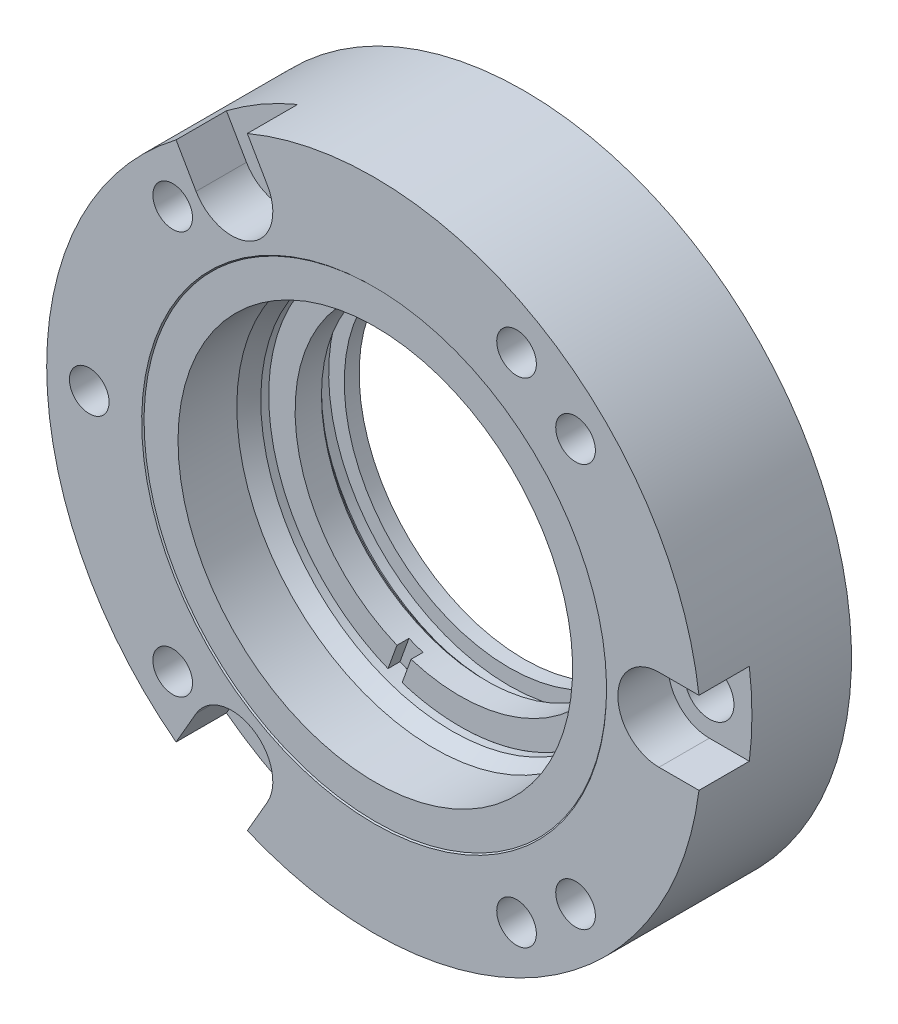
ISO-10303-21;
HEADER;
FILE_DESCRIPTION(('STEP AP214'),'2;1');
FILE_NAME('part.step','',(''),(''),'','','');
FILE_SCHEMA(('AUTOMOTIVE_DESIGN { 1 0 10303 214 1 1 1 1 }'));
ENDSEC;
DATA;
#1=APPLICATION_CONTEXT('core data for automotive mechanical design processes');
#2=APPLICATION_PROTOCOL_DEFINITION('international standard','automotive_design',2000,#1);
#3=PRODUCT_CONTEXT('',#1,'mechanical');
#4=PRODUCT('Part','Part','',(#3));
#5=PRODUCT_RELATED_PRODUCT_CATEGORY('part','',(#4));
#6=PRODUCT_DEFINITION_FORMATION('','',#4);
#7=PRODUCT_DEFINITION_CONTEXT('part definition',#1,'design');
#8=PRODUCT_DEFINITION('design','',#6,#7);
#9=PRODUCT_DEFINITION_SHAPE('','',#8);
#10=(LENGTH_UNIT() NAMED_UNIT(*) SI_UNIT(.MILLI.,.METRE.));
#11=(NAMED_UNIT(*) PLANE_ANGLE_UNIT() SI_UNIT($,.RADIAN.));
#12=(NAMED_UNIT(*) SI_UNIT($,.STERADIAN.) SOLID_ANGLE_UNIT());
#13=UNCERTAINTY_MEASURE_WITH_UNIT(LENGTH_MEASURE(1.E-05),#10,'distance_accuracy_value','');
#14=(GEOMETRIC_REPRESENTATION_CONTEXT(3) GLOBAL_UNCERTAINTY_ASSIGNED_CONTEXT((#13)) GLOBAL_UNIT_ASSIGNED_CONTEXT((#10,
#11,#12)) REPRESENTATION_CONTEXT('',''));
#15=CARTESIAN_POINT('',(0.,0.,0.));
#16=DIRECTION('',(0.,0.,1.));
#17=DIRECTION('',(1.,0.,0.));
#18=AXIS2_PLACEMENT_3D('',#15,#16,#17);
#19=CARTESIAN_POINT('',(0.,0.,15.748));
#20=DIRECTION('',(0.,0.,1.));
#21=DIRECTION('',(0.906307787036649,-0.422618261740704,0.));
#22=AXIS2_PLACEMENT_3D('',#19,#20,#21);
#23=PLANE('',#22);
#24=CARTESIAN_POINT('',(0.,0.,15.748));
#25=DIRECTION('',(0.,0.,1.));
#26=DIRECTION('',(0.906307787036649,-0.422618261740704,0.));
#27=AXIS2_PLACEMENT_3D('',#24,#25,#26);
#28=CIRCLE('',#27,20.8915);
#29=CARTESIAN_POINT('',(-18.9341291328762,8.82912941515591,15.748));
#30=VERTEX_POINT('',#29);
#31=EDGE_CURVE('P0_E51',#30,#30,#28,.T.);
#32=ORIENTED_EDGE('',*,*,#31,.F.);
#33=EDGE_LOOP('',(#32));
#34=FACE_BOUND('',#33,.T.);
#35=CARTESIAN_POINT('',(0.,0.,15.748));
#36=DIRECTION('',(0.,0.,1.));
#37=DIRECTION('',(0.906307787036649,-0.422618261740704,0.));
#38=AXIS2_PLACEMENT_3D('',#35,#36,#37);
#39=CIRCLE('',#38,24.6126);
#40=CARTESIAN_POINT('',(-22.3065910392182,10.4017342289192,15.748));
#41=VERTEX_POINT('',#40);
#42=EDGE_CURVE('P0_E10',#41,#41,#39,.T.);
#43=ORIENTED_EDGE('',*,*,#42,.T.);
#44=EDGE_LOOP('',(#43));
#45=FACE_BOUND('',#44,.T.);
#46=ADVANCED_FACE('P0_F14',(#34,#45),#23,.T.);
#47=CARTESIAN_POINT('',(0.,0.,12.7));
#48=DIRECTION('',(0.,0.,1.));
#49=DIRECTION('',(0.906307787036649,-0.422618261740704,0.));
#50=AXIS2_PLACEMENT_3D('',#47,#48,#49);
#51=PLANE('',#50);
#52=CARTESIAN_POINT('',(0.,0.,12.7));
#53=DIRECTION('',(0.,0.,1.));
#54=DIRECTION('',(0.906307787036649,-0.422618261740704,0.));
#55=AXIS2_PLACEMENT_3D('',#52,#53,#54);
#56=CIRCLE('',#55,22.9997);
#57=CARTESIAN_POINT('',(20.8448072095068,-9.72009323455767,12.7));
#58=VERTEX_POINT('',#57);
#59=EDGE_CURVE('P0_E43',#58,#58,#56,.T.);
#60=ORIENTED_EDGE('',*,*,#59,.T.);
#61=EDGE_LOOP('',(#60));
#62=FACE_BOUND('',#61,.T.);
#63=CARTESIAN_POINT('',(0.,0.,12.7));
#64=DIRECTION('',(0.,0.,1.));
#65=DIRECTION('',(0.906307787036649,-0.422618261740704,0.));
#66=AXIS2_PLACEMENT_3D('',#63,#64,#65);
#67=CIRCLE('',#66,24.6126);
#68=CARTESIAN_POINT('',(-22.3065910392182,10.4017342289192,12.7));
#69=VERTEX_POINT('',#68);
#70=EDGE_CURVE('P0_E18',#69,#69,#67,.T.);
#71=ORIENTED_EDGE('',*,*,#70,.F.);
#72=EDGE_LOOP('',(#71));
#73=FACE_BOUND('',#72,.T.);
#74=ADVANCED_FACE('P0_F64',(#62,#73),#51,.F.);
#75=CARTESIAN_POINT('',(0.,0.,15.748));
#76=DIRECTION('',(0.,0.,-1.));
#77=DIRECTION('',(-0.906307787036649,0.422618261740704,0.));
#78=AXIS2_PLACEMENT_3D('',#75,#76,#77);
#79=CYLINDRICAL_SURFACE('',#78,24.6126);
#80=CARTESIAN_POINT('',(-22.3065910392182,10.4017342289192,15.748));
#81=CARTESIAN_POINT('',(-22.3065910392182,10.4017342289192,15.71625));
#82=CARTESIAN_POINT('',(-22.3065910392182,10.4017342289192,15.6845));
#83=CARTESIAN_POINT('',(-22.3065910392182,10.4017342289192,15.621));
#84=CARTESIAN_POINT('',(-22.3065910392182,10.4017342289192,15.58925));
#85=CARTESIAN_POINT('',(-22.3065910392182,10.4017342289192,15.52575));
#86=CARTESIAN_POINT('',(-22.3065910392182,10.4017342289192,15.494));
#87=CARTESIAN_POINT('',(-22.3065910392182,10.4017342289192,15.4305));
#88=CARTESIAN_POINT('',(-22.3065910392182,10.4017342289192,15.39875));
#89=CARTESIAN_POINT('',(-22.3065910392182,10.4017342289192,15.33525));
#90=CARTESIAN_POINT('',(-22.3065910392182,10.4017342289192,15.3035));
#91=CARTESIAN_POINT('',(-22.3065910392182,10.4017342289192,15.24));
#92=CARTESIAN_POINT('',(-22.3065910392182,10.4017342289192,15.20825));
#93=CARTESIAN_POINT('',(-22.3065910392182,10.4017342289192,15.14475));
#94=CARTESIAN_POINT('',(-22.3065910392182,10.4017342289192,15.113));
#95=CARTESIAN_POINT('',(-22.3065910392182,10.4017342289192,15.0495));
#96=CARTESIAN_POINT('',(-22.3065910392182,10.4017342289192,15.01775));
#97=CARTESIAN_POINT('',(-22.3065910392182,10.4017342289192,14.95425));
#98=CARTESIAN_POINT('',(-22.3065910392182,10.4017342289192,14.9225));
#99=CARTESIAN_POINT('',(-22.3065910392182,10.4017342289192,14.859));
#100=CARTESIAN_POINT('',(-22.3065910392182,10.4017342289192,14.82725));
#101=CARTESIAN_POINT('',(-22.3065910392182,10.4017342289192,14.76375));
#102=CARTESIAN_POINT('',(-22.3065910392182,10.4017342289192,14.732));
#103=CARTESIAN_POINT('',(-22.3065910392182,10.4017342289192,14.6685));
#104=CARTESIAN_POINT('',(-22.3065910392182,10.4017342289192,14.63675));
#105=CARTESIAN_POINT('',(-22.3065910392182,10.4017342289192,14.57325));
#106=CARTESIAN_POINT('',(-22.3065910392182,10.4017342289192,14.5415));
#107=CARTESIAN_POINT('',(-22.3065910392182,10.4017342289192,14.478));
#108=CARTESIAN_POINT('',(-22.3065910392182,10.4017342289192,14.44625));
#109=CARTESIAN_POINT('',(-22.3065910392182,10.4017342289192,14.38275));
#110=CARTESIAN_POINT('',(-22.3065910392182,10.4017342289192,14.351));
#111=CARTESIAN_POINT('',(-22.3065910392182,10.4017342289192,14.2875));
#112=CARTESIAN_POINT('',(-22.3065910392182,10.4017342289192,14.25575));
#113=CARTESIAN_POINT('',(-22.3065910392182,10.4017342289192,14.19225));
#114=CARTESIAN_POINT('',(-22.3065910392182,10.4017342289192,14.1605));
#115=CARTESIAN_POINT('',(-22.3065910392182,10.4017342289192,14.097));
#116=CARTESIAN_POINT('',(-22.3065910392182,10.4017342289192,14.06525));
#117=CARTESIAN_POINT('',(-22.3065910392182,10.4017342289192,14.00175));
#118=CARTESIAN_POINT('',(-22.3065910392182,10.4017342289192,13.97));
#119=CARTESIAN_POINT('',(-22.3065910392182,10.4017342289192,13.9065));
#120=CARTESIAN_POINT('',(-22.3065910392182,10.4017342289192,13.87475));
#121=CARTESIAN_POINT('',(-22.3065910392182,10.4017342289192,13.81125));
#122=CARTESIAN_POINT('',(-22.3065910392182,10.4017342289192,13.7795));
#123=CARTESIAN_POINT('',(-22.3065910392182,10.4017342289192,13.716));
#124=CARTESIAN_POINT('',(-22.3065910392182,10.4017342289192,13.68425));
#125=CARTESIAN_POINT('',(-22.3065910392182,10.4017342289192,13.62075));
#126=CARTESIAN_POINT('',(-22.3065910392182,10.4017342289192,13.589));
#127=CARTESIAN_POINT('',(-22.3065910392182,10.4017342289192,13.5255));
#128=CARTESIAN_POINT('',(-22.3065910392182,10.4017342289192,13.49375));
#129=CARTESIAN_POINT('',(-22.3065910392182,10.4017342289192,13.43025));
#130=CARTESIAN_POINT('',(-22.3065910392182,10.4017342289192,13.3985));
#131=CARTESIAN_POINT('',(-22.3065910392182,10.4017342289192,13.335));
#132=CARTESIAN_POINT('',(-22.3065910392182,10.4017342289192,13.30325));
#133=CARTESIAN_POINT('',(-22.3065910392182,10.4017342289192,13.23975));
#134=CARTESIAN_POINT('',(-22.3065910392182,10.4017342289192,13.208));
#135=CARTESIAN_POINT('',(-22.3065910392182,10.4017342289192,13.1445));
#136=CARTESIAN_POINT('',(-22.3065910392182,10.4017342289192,13.11275));
#137=CARTESIAN_POINT('',(-22.3065910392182,10.4017342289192,13.04925));
#138=CARTESIAN_POINT('',(-22.3065910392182,10.4017342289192,13.0175));
#139=CARTESIAN_POINT('',(-22.3065910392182,10.4017342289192,12.954));
#140=CARTESIAN_POINT('',(-22.3065910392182,10.4017342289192,12.92225));
#141=CARTESIAN_POINT('',(-22.3065910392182,10.4017342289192,12.85875));
#142=CARTESIAN_POINT('',(-22.3065910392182,10.4017342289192,12.827));
#143=CARTESIAN_POINT('',(-22.3065910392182,10.4017342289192,12.7635));
#144=CARTESIAN_POINT('',(-22.3065910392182,10.4017342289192,12.73175));
#145=CARTESIAN_POINT('',(-22.3065910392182,10.4017342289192,12.7));
#146=B_SPLINE_CURVE_WITH_KNOTS('',3,(#80,#81,#82,#83,#84,#85,#86,#87,#88,#89,#90,#91,#92,#93,
#94,#95,#96,#97,#98,#99,#100,#101,#102,#103,#104,#105,#106,#107,#108,#109,#110,#111,#112,#113,
#114,#115,#116,#117,#118,#119,#120,#121,#122,#123,#124,#125,#126,#127,#128,#129,#130,#131,#132,
#133,#134,#135,#136,#137,#138,#139,#140,#141,#142,#143,#144,#145),.UNSPECIFIED.,.F.,.F.,(4,2,2,
2,2,2,2,2,2,2,2,2,2,2,2,2,2,2,2,2,2,2,2,2,2,2,2,2,2,2,2,2,4),(0.,0.0952500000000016,
0.190500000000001,0.285750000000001,0.381000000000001,0.476250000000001,0.571500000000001,
0.666750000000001,0.762000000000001,0.85725,0.9525,1.04775,1.143,1.23825,1.3335,1.42875,1.524,
1.61925,1.7145,1.80975,1.905,2.00025,2.0955,2.19075,2.286,2.38125,2.4765,2.57175,2.667,2.76225,
2.8575,2.95275,3.048),.UNSPECIFIED.);
#147=EDGE_CURVE('P0_BSEAM16',#41,#69,#146,.T.);
#148=ORIENTED_EDGE('',*,*,#42,.F.);
#149=ORIENTED_EDGE('',*,*,#70,.T.);
#150=ORIENTED_EDGE('',*,*,#147,.T.);
#151=ORIENTED_EDGE('',*,*,#147,.F.);
#152=EDGE_LOOP('',(#148,#150,#149,#151));
#153=FACE_BOUND('',#152,.T.);
#154=ADVANCED_FACE('P0_F16',(#153),#79,.T.);
#155=CARTESIAN_POINT('',(0.,0.,11.1252));
#156=DIRECTION('',(0.,0.,1.));
#157=DIRECTION('',(0.906307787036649,-0.422618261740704,0.));
#158=AXIS2_PLACEMENT_3D('',#155,#156,#157);
#159=TOROIDAL_SURFACE('',#158,22.9997,1.5748);
#160=ORIENTED_EDGE('',*,*,#59,.F.);
#161=EDGE_LOOP('',(#160));
#162=FACE_BOUND('',#161,.T.);
#163=CARTESIAN_POINT('',(0.,0.,11.1252));
#164=DIRECTION('',(0.,0.,1.));
#165=DIRECTION('',(0.906307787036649,-0.422618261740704,0.));
#166=AXIS2_PLACEMENT_3D('',#163,#164,#165);
#167=CIRCLE('',#166,21.4249);
#168=CARTESIAN_POINT('',(19.4175537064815,-9.0545539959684,11.1252));
#169=VERTEX_POINT('',#168);
#170=EDGE_CURVE('P0_E30',#169,#169,#167,.T.);
#171=ORIENTED_EDGE('',*,*,#170,.T.);
#172=EDGE_LOOP('',(#171));
#173=FACE_BOUND('',#172,.T.);
#174=ADVANCED_FACE('P0_F72',(#162,#173),#159,.F.);
#175=CARTESIAN_POINT('',(0.,0.,12.7));
#176=DIRECTION('',(0.,0.,1.));
#177=DIRECTION('',(0.906307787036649,-0.422618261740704,0.));
#178=AXIS2_PLACEMENT_3D('',#175,#176,#177);
#179=CYLINDRICAL_SURFACE('',#178,21.4249);
#180=ORIENTED_EDGE('',*,*,#170,.F.);
#181=EDGE_LOOP('',(#180));
#182=FACE_BOUND('',#181,.T.);
#183=CARTESIAN_POINT('',(0.,0.,10.16));
#184=DIRECTION('',(0.,0.,1.));
#185=DIRECTION('',(0.906307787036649,-0.422618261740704,0.));
#186=AXIS2_PLACEMENT_3D('',#183,#184,#185);
#187=CIRCLE('',#186,21.4249);
#188=CARTESIAN_POINT('',(19.4175537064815,-9.0545539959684,10.16));
#189=VERTEX_POINT('',#188);
#190=EDGE_CURVE('P0_E35',#189,#189,#187,.T.);
#191=ORIENTED_EDGE('',*,*,#190,.T.);
#192=EDGE_LOOP('',(#191));
#193=FACE_BOUND('',#192,.T.);
#194=ADVANCED_FACE('P0_F75',(#182,#193),#179,.T.);
#195=CARTESIAN_POINT('',(0.,0.,9.525));
#196=DIRECTION('',(0.,0.,1.));
#197=DIRECTION('',(0.906307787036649,-0.422618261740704,0.));
#198=AXIS2_PLACEMENT_3D('',#195,#196,#197);
#199=CONICAL_SURFACE('',#198,21.0582825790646,0.523598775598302);
#200=ORIENTED_EDGE('',*,*,#190,.F.);
#201=EDGE_LOOP('',(#200));
#202=FACE_BOUND('',#201,.T.);
#203=CARTESIAN_POINT('',(0.,0.,9.525));
#204=DIRECTION('',(0.,0.,1.));
#205=DIRECTION('',(0.906307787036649,-0.422618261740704,0.));
#206=AXIS2_PLACEMENT_3D('',#203,#204,#205);
#207=CIRCLE('',#206,21.0582825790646);
#208=CARTESIAN_POINT('',(19.0852854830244,-8.89961477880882,9.525));
#209=VERTEX_POINT('',#208);
#210=EDGE_CURVE('P0_E39',#209,#209,#207,.T.);
#211=ORIENTED_EDGE('',*,*,#210,.T.);
#212=EDGE_LOOP('',(#211));
#213=FACE_BOUND('',#212,.T.);
#214=ADVANCED_FACE('P0_F79',(#202,#213),#199,.T.);
#215=CARTESIAN_POINT('',(8.89961477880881,19.0852854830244,9.525));
#216=DIRECTION('',(0.,0.,1.));
#217=DIRECTION('',(0.906307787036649,-0.422618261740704,0.));
#218=AXIS2_PLACEMENT_3D('',#215,#216,#217);
#219=PLANE('',#218);
#220=CARTESIAN_POINT('',(0.,0.,9.525));
#221=DIRECTION('',(0.,0.,1.));
#222=DIRECTION('',(0.906307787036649,-0.422618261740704,0.));
#223=AXIS2_PLACEMENT_3D('',#220,#221,#222);
#224=CIRCLE('',#223,20.8915);
#225=CARTESIAN_POINT('',(-18.9341291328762,8.82912941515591,9.525));
#226=VERTEX_POINT('',#225);
#227=EDGE_CURVE('P0_E47',#226,#226,#224,.T.);
#228=ORIENTED_EDGE('',*,*,#227,.T.);
#229=EDGE_LOOP('',(#228));
#230=FACE_BOUND('',#229,.T.);
#231=ORIENTED_EDGE('',*,*,#210,.F.);
#232=EDGE_LOOP('',(#231));
#233=FACE_BOUND('',#232,.T.);
#234=ADVANCED_FACE('P0_F83',(#230,#233),#219,.F.);
#235=CARTESIAN_POINT('',(0.,0.,15.748));
#236=DIRECTION('',(0.,0.,-1.));
#237=DIRECTION('',(-0.906307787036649,0.422618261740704,0.));
#238=AXIS2_PLACEMENT_3D('',#235,#236,#237);
#239=CYLINDRICAL_SURFACE('',#238,20.8915);
#240=CARTESIAN_POINT('',(-18.9341291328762,8.82912941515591,15.748));
#241=CARTESIAN_POINT('',(-18.9341291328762,8.82912941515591,15.6831770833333));
#242=CARTESIAN_POINT('',(-18.9341291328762,8.82912941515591,15.6183541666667));
#243=CARTESIAN_POINT('',(-18.9341291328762,8.82912941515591,15.4887083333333));
#244=CARTESIAN_POINT('',(-18.9341291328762,8.82912941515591,15.4238854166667));
#245=CARTESIAN_POINT('',(-18.9341291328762,8.82912941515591,15.2942395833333));
#246=CARTESIAN_POINT('',(-18.9341291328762,8.82912941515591,15.2294166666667));
#247=CARTESIAN_POINT('',(-18.9341291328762,8.82912941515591,15.0997708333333));
#248=CARTESIAN_POINT('',(-18.9341291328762,8.82912941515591,15.0349479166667));
#249=CARTESIAN_POINT('',(-18.9341291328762,8.82912941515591,14.9053020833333));
#250=CARTESIAN_POINT('',(-18.9341291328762,8.82912941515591,14.8404791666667));
#251=CARTESIAN_POINT('',(-18.9341291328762,8.82912941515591,14.7108333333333));
#252=CARTESIAN_POINT('',(-18.9341291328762,8.82912941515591,14.6460104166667));
#253=CARTESIAN_POINT('',(-18.9341291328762,8.82912941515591,14.5163645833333));
#254=CARTESIAN_POINT('',(-18.9341291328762,8.82912941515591,14.4515416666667));
#255=CARTESIAN_POINT('',(-18.9341291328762,8.82912941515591,14.3218958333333));
#256=CARTESIAN_POINT('',(-18.9341291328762,8.82912941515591,14.2570729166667));
#257=CARTESIAN_POINT('',(-18.9341291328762,8.82912941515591,14.1274270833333));
#258=CARTESIAN_POINT('',(-18.9341291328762,8.82912941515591,14.0626041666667));
#259=CARTESIAN_POINT('',(-18.9341291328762,8.82912941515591,13.9329583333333));
#260=CARTESIAN_POINT('',(-18.9341291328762,8.82912941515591,13.8681354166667));
#261=CARTESIAN_POINT('',(-18.9341291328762,8.82912941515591,13.7384895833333));
#262=CARTESIAN_POINT('',(-18.9341291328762,8.82912941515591,13.6736666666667));
#263=CARTESIAN_POINT('',(-18.9341291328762,8.82912941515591,13.5440208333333));
#264=CARTESIAN_POINT('',(-18.9341291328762,8.82912941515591,13.4791979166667));
#265=CARTESIAN_POINT('',(-18.9341291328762,8.82912941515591,13.3495520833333));
#266=CARTESIAN_POINT('',(-18.9341291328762,8.82912941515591,13.2847291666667));
#267=CARTESIAN_POINT('',(-18.9341291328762,8.82912941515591,13.1550833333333));
#268=CARTESIAN_POINT('',(-18.9341291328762,8.82912941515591,13.0902604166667));
#269=CARTESIAN_POINT('',(-18.9341291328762,8.82912941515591,12.9606145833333));
#270=CARTESIAN_POINT('',(-18.9341291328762,8.82912941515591,12.8957916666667));
#271=CARTESIAN_POINT('',(-18.9341291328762,8.82912941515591,12.7661458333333));
#272=CARTESIAN_POINT('',(-18.9341291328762,8.82912941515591,12.7013229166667));
#273=CARTESIAN_POINT('',(-18.9341291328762,8.82912941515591,12.5716770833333));
#274=CARTESIAN_POINT('',(-18.9341291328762,8.82912941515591,12.5068541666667));
#275=CARTESIAN_POINT('',(-18.9341291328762,8.82912941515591,12.3772083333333));
#276=CARTESIAN_POINT('',(-18.9341291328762,8.82912941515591,12.3123854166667));
#277=CARTESIAN_POINT('',(-18.9341291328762,8.82912941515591,12.1827395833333));
#278=CARTESIAN_POINT('',(-18.9341291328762,8.82912941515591,12.1179166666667));
#279=CARTESIAN_POINT('',(-18.9341291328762,8.82912941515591,11.9882708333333));
#280=CARTESIAN_POINT('',(-18.9341291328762,8.82912941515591,11.9234479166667));
#281=CARTESIAN_POINT('',(-18.9341291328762,8.82912941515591,11.7938020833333));
#282=CARTESIAN_POINT('',(-18.9341291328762,8.82912941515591,11.7289791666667));
#283=CARTESIAN_POINT('',(-18.9341291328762,8.82912941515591,11.5993333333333));
#284=CARTESIAN_POINT('',(-18.9341291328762,8.82912941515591,11.5345104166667));
#285=CARTESIAN_POINT('',(-18.9341291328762,8.82912941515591,11.4048645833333));
#286=CARTESIAN_POINT('',(-18.9341291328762,8.82912941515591,11.3400416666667));
#287=CARTESIAN_POINT('',(-18.9341291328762,8.82912941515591,11.2103958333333));
#288=CARTESIAN_POINT('',(-18.9341291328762,8.82912941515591,11.1455729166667));
#289=CARTESIAN_POINT('',(-18.9341291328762,8.82912941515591,11.0159270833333));
#290=CARTESIAN_POINT('',(-18.9341291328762,8.82912941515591,10.9511041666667));
#291=CARTESIAN_POINT('',(-18.9341291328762,8.82912941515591,10.8214583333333));
#292=CARTESIAN_POINT('',(-18.9341291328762,8.82912941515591,10.7566354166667));
#293=CARTESIAN_POINT('',(-18.9341291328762,8.82912941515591,10.6269895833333));
#294=CARTESIAN_POINT('',(-18.9341291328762,8.82912941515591,10.5621666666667));
#295=CARTESIAN_POINT('',(-18.9341291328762,8.82912941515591,10.4325208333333));
#296=CARTESIAN_POINT('',(-18.9341291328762,8.82912941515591,10.3676979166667));
#297=CARTESIAN_POINT('',(-18.9341291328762,8.82912941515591,10.2380520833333));
#298=CARTESIAN_POINT('',(-18.9341291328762,8.82912941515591,10.1732291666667));
#299=CARTESIAN_POINT('',(-18.9341291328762,8.82912941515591,10.0435833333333));
#300=CARTESIAN_POINT('',(-18.9341291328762,8.82912941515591,9.97876041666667));
#301=CARTESIAN_POINT('',(-18.9341291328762,8.82912941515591,9.84911458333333));
#302=CARTESIAN_POINT('',(-18.9341291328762,8.82912941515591,9.78429166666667));
#303=CARTESIAN_POINT('',(-18.9341291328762,8.82912941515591,9.65464583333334));
#304=CARTESIAN_POINT('',(-18.9341291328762,8.82912941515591,9.58982291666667));
#305=CARTESIAN_POINT('',(-18.9341291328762,8.82912941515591,9.525));
#306=B_SPLINE_CURVE_WITH_KNOTS('',3,(#240,#241,#242,#243,#244,#245,#246,#247,#248,#249,#250,
#251,#252,#253,#254,#255,#256,#257,#258,#259,#260,#261,#262,#263,#264,#265,#266,#267,#268,#269,
#270,#271,#272,#273,#274,#275,#276,#277,#278,#279,#280,#281,#282,#283,#284,#285,#286,#287,#288,
#289,#290,#291,#292,#293,#294,#295,#296,#297,#298,#299,#300,#301,#302,#303,#304,#305),
.UNSPECIFIED.,.F.,.F.,(4,2,2,2,2,2,2,2,2,2,2,2,2,2,2,2,2,2,2,2,2,2,2,2,2,2,2,2,2,2,2,2,4),(0.,
0.194468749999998,0.388937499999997,0.583406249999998,0.777874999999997,0.972343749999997,
1.1668125,1.36128125,1.55575,1.75021875,1.9446875,2.13915625,2.333625,2.52809374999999,
2.72256249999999,2.91703124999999,3.11149999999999,3.30596874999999,3.50043749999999,
3.69490624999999,3.88937499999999,4.08384374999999,4.27831249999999,4.47278124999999,
4.66724999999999,4.86171874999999,5.05618749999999,5.25065624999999,5.44512499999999,
5.63959374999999,5.83406249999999,6.02853124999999,6.22299999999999),.UNSPECIFIED.);
#307=EDGE_CURVE('P0_BSEAM60',#30,#226,#306,.T.);
#308=ORIENTED_EDGE('',*,*,#31,.T.);
#309=ORIENTED_EDGE('',*,*,#227,.F.);
#310=ORIENTED_EDGE('',*,*,#307,.T.);
#311=ORIENTED_EDGE('',*,*,#307,.F.);
#312=EDGE_LOOP('',(#308,#310,#309,#311));
#313=FACE_BOUND('',#312,.T.);
#314=ADVANCED_FACE('P0_F60',(#313),#239,.F.);
#315=CLOSED_SHELL('',(#46,#74,#154,#174,#194,#214,#234,#314));
#316=MANIFOLD_SOLID_BREP('P0_B1',#315);
#317=CARTESIAN_POINT('',(-8.60379315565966,-21.4676915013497,5.51179999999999));
#318=DIRECTION('',(-0.940448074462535,0.339937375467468,0.));
#319=DIRECTION('',(-0.339937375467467,-0.940448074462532,0.));
#320=AXIS2_PLACEMENT_3D('',#317,#318,#319);
#321=PLANE('',#320);
#322=DIRECTION('',(-0.339937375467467,-0.940448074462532,0.));
#323=VECTOR('',#322,1.);
#324=CARTESIAN_POINT('',(-8.60379315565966,-21.4676915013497,5.51179999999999));
#325=LINE('',#324,#323);
#326=CARTESIAN_POINT('',(-6.67650151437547,-16.1357749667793,5.51179999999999));
#327=VERTEX_POINT('',#326);
#328=CARTESIAN_POINT('',(-7.7567473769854,-19.1243111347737,5.51179999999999));
#329=VERTEX_POINT('',#328);
#330=EDGE_CURVE('P1_E146',#327,#329,#325,.T.);
#331=ORIENTED_EDGE('',*,*,#330,.F.);
#332=DIRECTION('',(0.,0.,0.999999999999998));
#333=VECTOR('',#332,1.);
#334=CARTESIAN_POINT('',(-6.67650151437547,-16.1357749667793,35.5599999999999));
#335=LINE('',#334,#333);
#336=CARTESIAN_POINT('',(-6.67650151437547,-16.1357749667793,6.7818));
#337=VERTEX_POINT('',#336);
#338=EDGE_CURVE('P1_E277',#337,#327,#335,.F.);
#339=ORIENTED_EDGE('',*,*,#338,.F.);
#340=DIRECTION('',(-0.339937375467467,-0.940448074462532,0.));
#341=VECTOR('',#340,1.);
#342=CARTESIAN_POINT('',(-8.60379315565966,-21.4676915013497,6.7818));
#343=LINE('',#342,#341);
#344=CARTESIAN_POINT('',(-7.62713352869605,-18.7657301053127,6.7818));
#345=VERTEX_POINT('',#344);
#346=EDGE_CURVE('P1_E263',#337,#345,#343,.T.);
#347=ORIENTED_EDGE('',*,*,#346,.T.);
#348=CARTESIAN_POINT('',(-1.85078312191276,-2.78526426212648,23.6941864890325));
#349=CARTESIAN_POINT('',(-1.89058707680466,-2.89538322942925,23.5804315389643));
#350=CARTESIAN_POINT('',(-1.93033539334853,-3.00534827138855,23.4665085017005));
#351=CARTESIAN_POINT('',(-2.00974366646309,-3.22503390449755,23.2383966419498));
#352=CARTESIAN_POINT('',(-2.04940362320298,-3.33475449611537,23.1242078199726));
#353=CARTESIAN_POINT('',(-2.16828513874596,-3.663644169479,22.7813488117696));
#354=CARTESIAN_POINT('',(-2.24740876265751,-3.8825423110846,22.552384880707));
#355=CARTESIAN_POINT('',(-2.40549380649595,-4.31988985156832,22.0939767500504));
#356=CARTESIAN_POINT('',(-2.48445522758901,-4.53833925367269,21.8645325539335));
#357=CARTESIAN_POINT('',(-2.64226976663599,-4.97493843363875,21.4053213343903));
#358=CARTESIAN_POINT('',(-2.72112288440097,-5.19308821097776,21.1755543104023));
#359=CARTESIAN_POINT('',(-2.9575678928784,-5.8472212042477,20.4859340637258));
#360=CARTESIAN_POINT('',(-3.11504884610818,-6.28289750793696,20.0257517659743));
#361=CARTESIAN_POINT('',(-3.42985192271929,-7.15381070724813,19.104917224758));
#362=CARTESIAN_POINT('',(-3.58717404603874,-7.58904760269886,18.6442649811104));
#363=CARTESIAN_POINT('',(-4.05899912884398,-8.89436741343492,17.2618910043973));
#364=CARTESIAN_POINT('',(-4.37336080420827,-9.76405946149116,16.3397520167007));
#365=CARTESIAN_POINT('',(-5.00192486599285,-11.5030028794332,14.4949908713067));
#366=CARTESIAN_POINT('',(-5.31612725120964,-12.3722542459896,13.5723687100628));
#367=CARTESIAN_POINT('',(-5.94444202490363,-14.1105080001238,11.7268596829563));
#368=CARTESIAN_POINT('',(-6.25855441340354,-14.9795103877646,10.8039728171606));
#369=CARTESIAN_POINT('',(-6.69189368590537,-16.1783579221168,9.53057443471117));
#370=CARTESIAN_POINT('',(-6.81114309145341,-16.5082653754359,9.18012922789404));
#371=CARTESIAN_POINT('',(-7.04963505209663,-17.1680613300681,8.47922003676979));
#372=CARTESIAN_POINT('',(-7.16887760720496,-17.4979498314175,8.1287560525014));
#373=CARTESIAN_POINT('',(-7.74029732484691,-19.0788015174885,6.44922919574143));
#374=CARTESIAN_POINT('',(-8.19243849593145,-20.3296651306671,5.12006035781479));
#375=CARTESIAN_POINT('',(-9.09667713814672,-22.8312714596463,2.46159403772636));
#376=CARTESIAN_POINT('',(-9.54877460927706,-24.0820141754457,1.13229655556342));
#377=CARTESIAN_POINT('',(-10.4529463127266,-26.5834353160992,-1.52639153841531));
#378=CARTESIAN_POINT('',(-10.9050205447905,-27.8341137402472,-2.85578215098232));
#379=CARTESIAN_POINT('',(-11.809150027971,-30.33541807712,-5.51461919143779));
#380=CARTESIAN_POINT('',(-12.2612052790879,-31.5860439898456,-6.84406561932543));
#381=CARTESIAN_POINT('',(-12.7132552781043,-32.8366553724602,-8.17352749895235));
#382=B_SPLINE_CURVE_WITH_KNOTS('',3,(#348,#349,#350,#351,#352,#353,#354,#355,#356,#357,#358,
#359,#360,#361,#362,#363,#364,#365,#366,#367,#368,#369,#370,#371,#372,#373,#374,#375,#376,#377,
#378,#379,#380,#381),.UNSPECIFIED.,.F.,.F.,(4,2,2,2,2,2,2,2,2,2,2,2,2,2,2,2,4),(0.,
0.489750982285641,0.979501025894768,1.95899594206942,2.93848379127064,3.91797334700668,
5.87691019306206,7.83584780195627,11.7537229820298,15.6716273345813,19.5895306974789,
21.0770927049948,22.5646517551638,28.205753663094,33.8468556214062,39.4880100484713,
45.1291643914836),.UNSPECIFIED.);
#383=CARTESIAN_POINT('',(-7.7567473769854,-19.1243111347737,6.40079999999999));
#384=VERTEX_POINT('',#383);
#385=EDGE_CURVE('P1_E230',#345,#384,#382,.T.);
#386=ORIENTED_EDGE('',*,*,#385,.T.);
#387=DIRECTION('',(0.,0.,0.999999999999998));
#388=VECTOR('',#387,1.);
#389=CARTESIAN_POINT('',(-7.7567473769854,-19.1243111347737,35.5599999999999));
#390=LINE('',#389,#388);
#391=EDGE_CURVE('P1_E172',#329,#384,#390,.T.);
#392=ORIENTED_EDGE('',*,*,#391,.F.);
#393=EDGE_LOOP('',(#331,#339,#347,#386,#392));
#394=FACE_BOUND('',#393,.T.);
#395=ADVANCED_FACE('P1_F16',(#394),#321,.F.);
#396=CARTESIAN_POINT('',(-8.60379315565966,-21.4676915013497,5.51179999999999));
#397=DIRECTION('',(0.,0.,-0.999999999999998));
#398=DIRECTION('',(-0.339937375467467,-0.940448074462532,0.));
#399=AXIS2_PLACEMENT_3D('',#396,#397,#398);
#400=PLANE('',#399);
#401=CARTESIAN_POINT('',(6.26378605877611,19.6639617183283,5.51179999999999));
#402=VERTEX_POINT('',#401);
#403=CARTESIAN_POINT('',(5.1835401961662,16.6754255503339,5.51179999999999));
#404=VERTEX_POINT('',#403);
#405=EDGE_CURVE('P1_E135',#402,#404,#325,.T.);
#406=ORIENTED_EDGE('',*,*,#405,.T.);
#407=CARTESIAN_POINT('',(0.,0.,5.51179999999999));
#408=DIRECTION('',(0.,0.,-0.999999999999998));
#409=DIRECTION('',(-0.339937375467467,-0.940448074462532,0.));
#410=AXIS2_PLACEMENT_3D('',#407,#408,#409);
#411=CIRCLE('',#410,17.4625);
#412=CARTESIAN_POINT('',(6.67650151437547,16.1357749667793,5.51179999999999));
#413=VERTEX_POINT('',#412);
#414=EDGE_CURVE('P1_E119',#413,#404,#411,.F.);
#415=ORIENTED_EDGE('',*,*,#414,.F.);
#416=DIRECTION('',(0.339937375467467,0.940448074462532,0.));
#417=VECTOR('',#416,1.);
#418=CARTESIAN_POINT('',(-7.1108318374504,-22.0073420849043,5.51179999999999));
#419=LINE('',#418,#417);
#420=CARTESIAN_POINT('',(7.75674737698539,19.1243111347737,5.51179999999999));
#421=VERTEX_POINT('',#420);
#422=EDGE_CURVE('P1_E145',#413,#421,#419,.T.);
#423=ORIENTED_EDGE('',*,*,#422,.T.);
#424=CARTESIAN_POINT('',(0.,0.,5.51179999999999));
#425=DIRECTION('',(0.,0.,-0.999999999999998));
#426=DIRECTION('',(-0.339937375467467,-0.940448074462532,0.));
#427=AXIS2_PLACEMENT_3D('',#424,#425,#426);
#428=CIRCLE('',#427,20.6375);
#429=EDGE_CURVE('P1_E11',#402,#421,#428,.T.);
#430=ORIENTED_EDGE('',*,*,#429,.F.);
#431=EDGE_LOOP('',(#406,#415,#423,#430));
#432=FACE_BOUND('',#431,.T.);
#433=ADVANCED_FACE('P1_F142',(#432),#400,.F.);
#434=CARTESIAN_POINT('',(-7.1108318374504,-22.0073420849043,5.51179999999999));
#435=DIRECTION('',(0.940448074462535,-0.339937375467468,0.));
#436=DIRECTION('',(0.339937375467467,0.940448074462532,0.));
#437=AXIS2_PLACEMENT_3D('',#434,#435,#436);
#438=PLANE('',#437);
#439=ORIENTED_EDGE('',*,*,#422,.F.);
#440=DIRECTION('',(0.,0.,0.999999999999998));
#441=VECTOR('',#440,1.);
#442=CARTESIAN_POINT('',(6.67650151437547,16.1357749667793,35.5599999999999));
#443=LINE('',#442,#441);
#444=CARTESIAN_POINT('',(6.67650151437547,16.1357749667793,6.7818));
#445=VERTEX_POINT('',#444);
#446=EDGE_CURVE('P1_E125',#445,#413,#443,.F.);
#447=ORIENTED_EDGE('',*,*,#446,.F.);
#448=DIRECTION('',(0.339937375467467,0.940448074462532,0.));
#449=VECTOR('',#448,1.);
#450=CARTESIAN_POINT('',(-7.1108318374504,-22.0073420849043,6.7818));
#451=LINE('',#450,#449);
#452=CARTESIAN_POINT('',(7.62713352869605,18.7657301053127,6.7818));
#453=VERTEX_POINT('',#452);
#454=EDGE_CURVE('P1_E48',#445,#453,#451,.T.);
#455=ORIENTED_EDGE('',*,*,#454,.T.);
#456=CARTESIAN_POINT('',(1.85078312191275,2.78526426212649,23.6941864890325));
#457=CARTESIAN_POINT('',(1.89058707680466,2.89538322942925,23.5804315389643));
#458=CARTESIAN_POINT('',(1.93033539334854,3.00534827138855,23.4665085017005));
#459=CARTESIAN_POINT('',(2.0097436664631,3.22503390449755,23.2383966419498));
#460=CARTESIAN_POINT('',(2.04940362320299,3.33475449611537,23.1242078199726));
#461=CARTESIAN_POINT('',(2.16828513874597,3.66364416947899,22.7813488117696));
#462=CARTESIAN_POINT('',(2.24740876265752,3.88254231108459,22.552384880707));
#463=CARTESIAN_POINT('',(2.40549380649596,4.31988985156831,22.0939767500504));
#464=CARTESIAN_POINT('',(2.48445522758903,4.53833925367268,21.8645325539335));
#465=CARTESIAN_POINT('',(2.64226976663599,4.97493843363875,21.4053213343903));
#466=CARTESIAN_POINT('',(2.72112288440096,5.19308821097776,21.1755543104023));
#467=CARTESIAN_POINT('',(2.95756789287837,5.84722120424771,20.4859340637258));
#468=CARTESIAN_POINT('',(3.11504884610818,6.28289750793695,20.0257517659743));
#469=CARTESIAN_POINT('',(3.42985192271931,7.15381070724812,19.104917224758));
#470=CARTESIAN_POINT('',(3.58717404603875,7.58904760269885,18.6442649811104));
#471=CARTESIAN_POINT('',(4.05899912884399,8.89436741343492,17.2618910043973));
#472=CARTESIAN_POINT('',(4.37336080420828,9.76405946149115,16.3397520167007));
#473=CARTESIAN_POINT('',(5.00192486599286,11.5030028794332,14.4949908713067));
#474=CARTESIAN_POINT('',(5.31612725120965,12.3722542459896,13.5723687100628));
#475=CARTESIAN_POINT('',(5.94444202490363,14.1105080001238,11.7268596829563));
#476=CARTESIAN_POINT('',(6.25855441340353,14.9795103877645,10.8039728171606));
#477=CARTESIAN_POINT('',(6.69189368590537,16.1783579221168,9.53057443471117));
#478=CARTESIAN_POINT('',(6.81114309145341,16.5082653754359,9.18012922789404));
#479=CARTESIAN_POINT('',(7.04963505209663,17.1680613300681,8.47922003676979));
#480=CARTESIAN_POINT('',(7.16887760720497,17.4979498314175,8.1287560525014));
#481=CARTESIAN_POINT('',(7.74029732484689,19.0788015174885,6.44922919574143));
#482=CARTESIAN_POINT('',(8.19243849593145,20.3296651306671,5.12006035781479));
#483=CARTESIAN_POINT('',(9.09667713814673,22.8312714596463,2.46159403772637));
#484=CARTESIAN_POINT('',(9.54877460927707,24.0820141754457,1.13229655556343));
#485=CARTESIAN_POINT('',(10.4529463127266,26.5834353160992,-1.5263915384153));
#486=CARTESIAN_POINT('',(10.9050205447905,27.8341137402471,-2.85578215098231));
#487=CARTESIAN_POINT('',(11.809150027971,30.33541807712,-5.51461919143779));
#488=CARTESIAN_POINT('',(12.2612052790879,31.5860439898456,-6.84406561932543));
#489=CARTESIAN_POINT('',(12.7132552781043,32.8366553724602,-8.17352749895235));
#490=B_SPLINE_CURVE_WITH_KNOTS('',3,(#456,#457,#458,#459,#460,#461,#462,#463,#464,#465,#466,
#467,#468,#469,#470,#471,#472,#473,#474,#475,#476,#477,#478,#479,#480,#481,#482,#483,#484,#485,
#486,#487,#488,#489),.UNSPECIFIED.,.F.,.F.,(4,2,2,2,2,2,2,2,2,2,2,2,2,2,2,2,4),(0.,
0.489750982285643,0.979501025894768,1.95899594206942,2.93848379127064,3.91797334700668,
5.87691019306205,7.83584780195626,11.7537229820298,15.6716273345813,19.5895306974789,
21.0770927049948,22.5646517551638,28.205753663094,33.8468556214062,39.4880100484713,
45.1291643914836),.UNSPECIFIED.);
#491=CARTESIAN_POINT('',(7.75674737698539,19.1243111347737,6.40079999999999));
#492=VERTEX_POINT('',#491);
#493=EDGE_CURVE('P1_E194',#453,#492,#490,.T.);
#494=ORIENTED_EDGE('',*,*,#493,.T.);
#495=DIRECTION('',(0.,0.,0.999999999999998));
#496=VECTOR('',#495,1.);
#497=CARTESIAN_POINT('',(7.75674737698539,19.1243111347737,35.5599999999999));
#498=LINE('',#497,#496);
#499=EDGE_CURVE('P1_E161',#421,#492,#498,.T.);
#500=ORIENTED_EDGE('',*,*,#499,.F.);
#501=EDGE_LOOP('',(#439,#447,#455,#494,#500));
#502=FACE_BOUND('',#501,.T.);
#503=ADVANCED_FACE('P1_F219',(#502),#438,.F.);
#504=CARTESIAN_POINT('',(-16.422574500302,5.93615641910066,6.7818));
#505=DIRECTION('',(0.,0.,-0.999999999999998));
#506=DIRECTION('',(-0.339937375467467,-0.940448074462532,0.));
#507=AXIS2_PLACEMENT_3D('',#504,#505,#506);
#508=PLANE('',#507);
#509=ORIENTED_EDGE('',*,*,#346,.F.);
#510=CARTESIAN_POINT('',(0.,0.,6.7818));
#511=DIRECTION('',(0.,0.,0.999999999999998));
#512=DIRECTION('',(0.339937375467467,0.940448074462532,0.));
#513=AXIS2_PLACEMENT_3D('',#510,#511,#512);
#514=CIRCLE('',#513,17.4625);
#515=CARTESIAN_POINT('',(5.1835401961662,16.6754255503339,6.7818));
#516=VERTEX_POINT('',#515);
#517=EDGE_CURVE('P1_E140',#516,#337,#514,.T.);
#518=ORIENTED_EDGE('',*,*,#517,.F.);
#519=CARTESIAN_POINT('',(6.13417221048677,19.3053806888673,6.7818));
#520=VERTEX_POINT('',#519);
#521=EDGE_CURVE('P1_E138',#520,#516,#343,.T.);
#522=ORIENTED_EDGE('',*,*,#521,.F.);
#523=CARTESIAN_POINT('',(0.,0.,6.7818));
#524=DIRECTION('',(0.,0.,-0.999999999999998));
#525=DIRECTION('',(-0.339937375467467,-0.940448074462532,0.));
#526=AXIS2_PLACEMENT_3D('',#523,#524,#525);
#527=CIRCLE('',#526,20.2565);
#528=EDGE_CURVE('P1_E180',#520,#345,#527,.F.);
#529=ORIENTED_EDGE('',*,*,#528,.T.);
#530=EDGE_LOOP('',(#509,#518,#522,#529));
#531=FACE_BOUND('',#530,.T.);
#532=ADVANCED_FACE('P1_F390',(#531),#508,.F.);
#533=CARTESIAN_POINT('',(0.,0.,6.7818));
#534=DIRECTION('',(0.,0.,-0.999999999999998));
#535=DIRECTION('',(-0.339937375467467,-0.940448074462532,0.));
#536=AXIS2_PLACEMENT_3D('',#533,#534,#535);
#537=CONICAL_SURFACE('',#536,20.2565,0.785398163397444);
#538=ORIENTED_EDGE('',*,*,#385,.F.);
#539=ORIENTED_EDGE('',*,*,#528,.F.);
#540=CARTESIAN_POINT('',(11.220293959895,33.3763059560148,-8.17352749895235));
#541=CARTESIAN_POINT('',(10.7682456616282,32.1256992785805,-6.84407063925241));
#542=CARTESIAN_POINT('',(10.3161921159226,30.875078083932,-5.51462921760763));
#543=CARTESIAN_POINT('',(9.41206625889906,28.3737837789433,-2.85580282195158));
#544=CARTESIAN_POINT('',(8.95999394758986,27.1231106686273,-1.52641784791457));
#545=CARTESIAN_POINT('',(8.05582244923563,24.6216900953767,1.13226960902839));
#546=CARTESIAN_POINT('',(7.60372326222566,23.3709426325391,2.46157209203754));
#547=CARTESIAN_POINT('',(6.69948101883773,20.8693263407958,5.12004913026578));
#548=CARTESIAN_POINT('',(6.2473379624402,19.6184575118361,6.4492236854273));
#549=CARTESIAN_POINT('',(5.56906465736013,17.7419918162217,8.44281612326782));
#550=CARTESIAN_POINT('',(5.34296347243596,17.1164753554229,9.1073195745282));
#551=CARTESIAN_POINT('',(4.89073379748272,15.8653668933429,10.4362458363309));
#552=CARTESIAN_POINT('',(4.66460530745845,15.2397748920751,11.1006686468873));
#553=CARTESIAN_POINT('',(4.21230947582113,13.9884834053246,12.4293980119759));
#554=CARTESIAN_POINT('',(3.9861421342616,13.36278391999,13.0937045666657));
#555=CARTESIAN_POINT('',(3.53374769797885,12.1112196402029,14.4221424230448));
#556=CARTESIAN_POINT('',(3.30752060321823,11.4853548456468,15.0862737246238));
#557=CARTESIAN_POINT('',(2.85497015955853,10.2333589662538,16.4142588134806));
#558=CARTESIAN_POINT('',(2.62864681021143,9.60722788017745,17.0781125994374));
#559=CARTESIAN_POINT('',(2.28903259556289,8.66767384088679,18.0735104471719));
#560=CARTESIAN_POINT('',(2.1758064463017,8.35442992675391,18.4052455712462));
#561=CARTESIAN_POINT('',(1.94929248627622,7.72777150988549,19.0685340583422));
#562=CARTESIAN_POINT('',(1.83600467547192,7.41435700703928,19.4000874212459));
#563=CARTESIAN_POINT('',(1.60933821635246,6.78727669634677,20.0629302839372));
#564=CARTESIAN_POINT('',(1.4959595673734,6.47361088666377,20.3942197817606));
#565=CARTESIAN_POINT('',(1.26906440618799,5.84589786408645,21.0563890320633));
#566=CARTESIAN_POINT('',(1.15554789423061,5.53185065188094,21.3872687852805));
#567=CARTESIAN_POINT('',(0.985097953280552,5.06029521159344,21.8830702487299));
#568=CARTESIAN_POINT('',(0.928251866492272,4.9030286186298,22.0482517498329));
#569=CARTESIAN_POINT('',(0.814479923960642,4.58827474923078,22.3783765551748));
#570=CARTESIAN_POINT('',(0.757554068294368,4.43078747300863,22.5433198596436));
#571=CARTESIAN_POINT('',(0.643593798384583,4.11551258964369,22.8728840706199));
#572=CARTESIAN_POINT('',(0.586559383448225,3.95772498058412,23.0375049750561));
#573=CARTESIAN_POINT('',(0.472327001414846,3.64169728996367,23.3662559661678));
#574=CARTESIAN_POINT('',(0.415129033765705,3.48345720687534,23.5303860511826));
#575=CARTESIAN_POINT('',(0.357821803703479,3.32491484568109,23.6941864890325));
#576=B_SPLINE_CURVE_WITH_KNOTS('',3,(#540,#541,#542,#543,#544,#545,#546,#547,#548,#549,#550,
#551,#552,#553,#554,#555,#556,#557,#558,#559,#560,#561,#562,#563,#564,#565,#566,#567,#568,#569,
#570,#571,#572,#573,#574,#575),.UNSPECIFIED.,.F.,.F.,(4,2,2,2,2,2,2,2,2,2,2,2,2,2,2,2,2,4),(0.,
5.64113308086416,11.2822635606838,16.9233868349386,22.5645126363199,25.3850829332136,
28.2056527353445,31.0262186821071,33.8467863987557,36.667367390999,38.0776548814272,
39.4879432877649,40.8982420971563,42.3085383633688,43.0136925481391,43.7188460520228,
44.4240040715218,45.1291644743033),.UNSPECIFIED.);
#577=CARTESIAN_POINT('',(6.26378605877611,19.6639617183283,6.40079999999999));
#578=VERTEX_POINT('',#577);
#579=EDGE_CURVE('P1_E226',#578,#520,#576,.T.);
#580=ORIENTED_EDGE('',*,*,#579,.F.);
#581=CARTESIAN_POINT('',(0.,0.,6.40079999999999));
#582=DIRECTION('',(0.,0.,-0.999999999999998));
#583=DIRECTION('',(-0.339937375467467,-0.940448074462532,0.));
#584=AXIS2_PLACEMENT_3D('',#581,#582,#583);
#585=CIRCLE('',#584,20.6375);
#586=EDGE_CURVE('P1_E190',#384,#578,#585,.T.);
#587=ORIENTED_EDGE('',*,*,#586,.F.);
#588=EDGE_LOOP('',(#538,#539,#580,#587));
#589=FACE_BOUND('',#588,.T.);
#590=ADVANCED_FACE('P1_F401',(#589),#537,.T.);
#591=CARTESIAN_POINT('',(-16.422574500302,5.93615641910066,3.6068));
#592=DIRECTION('',(0.,0.,0.999999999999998));
#593=DIRECTION('',(0.339937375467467,0.940448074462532,0.));
#594=AXIS2_PLACEMENT_3D('',#591,#592,#593);
#595=PLANE('',#594);
#596=CARTESIAN_POINT('',(0.,0.,3.6068));
#597=DIRECTION('',(0.,0.,0.999999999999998));
#598=DIRECTION('',(0.339937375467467,0.940448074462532,0.));
#599=AXIS2_PLACEMENT_3D('',#596,#597,#598);
#600=CIRCLE('',#599,17.8435);
#601=CARTESIAN_POINT('',(-6.06567255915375,-16.7808852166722,3.6068));
#602=VERTEX_POINT('',#601);
#603=EDGE_CURVE('P1_E130',#602,#602,#600,.T.);
#604=ORIENTED_EDGE('',*,*,#603,.T.);
#605=EDGE_LOOP('',(#604));
#606=FACE_BOUND('',#605,.T.);
#607=CARTESIAN_POINT('',(0.,0.,3.6068));
#608=DIRECTION('',(0.,0.,0.999999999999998));
#609=DIRECTION('',(0.339937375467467,0.940448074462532,0.));
#610=AXIS2_PLACEMENT_3D('',#607,#608,#609);
#611=CIRCLE('',#610,20.2565);
#612=CARTESIAN_POINT('',(6.88594144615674,19.0501864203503,3.6068));
#613=VERTEX_POINT('',#612);
#614=EDGE_CURVE('P1_E176',#613,#613,#611,.F.);
#615=ORIENTED_EDGE('',*,*,#614,.T.);
#616=EDGE_LOOP('',(#615));
#617=FACE_BOUND('',#616,.T.);
#618=ADVANCED_FACE('P1_F18',(#606,#617),#595,.F.);
#619=CARTESIAN_POINT('',(0.,0.,35.5599999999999));
#620=DIRECTION('',(0.,0.,0.999999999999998));
#621=DIRECTION('',(0.339937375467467,0.940448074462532,0.));
#622=AXIS2_PLACEMENT_3D('',#619,#620,#621);
#623=CYLINDRICAL_SURFACE('',#622,20.6375);
#624=ORIENTED_EDGE('',*,*,#586,.T.);
#625=DIRECTION('',(0.,0.,0.999999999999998));
#626=VECTOR('',#625,1.);
#627=CARTESIAN_POINT('',(6.26378605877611,19.6639617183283,35.5599999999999));
#628=LINE('',#627,#626);
#629=EDGE_CURVE('P1_E169',#578,#402,#628,.F.);
#630=ORIENTED_EDGE('',*,*,#629,.T.);
#631=ORIENTED_EDGE('',*,*,#429,.T.);
#632=ORIENTED_EDGE('',*,*,#499,.T.);
#633=CARTESIAN_POINT('',(-6.26378605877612,-19.6639617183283,6.40079999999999));
#634=VERTEX_POINT('',#633);
#635=EDGE_CURVE('P1_E189',#492,#634,#585,.T.);
#636=ORIENTED_EDGE('',*,*,#635,.T.);
#637=DIRECTION('',(0.,0.,0.999999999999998));
#638=VECTOR('',#637,1.);
#639=CARTESIAN_POINT('',(-6.26378605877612,-19.6639617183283,35.5599999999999));
#640=LINE('',#639,#638);
#641=CARTESIAN_POINT('',(-6.26378605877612,-19.6639617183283,5.51179999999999));
#642=VERTEX_POINT('',#641);
#643=EDGE_CURVE('P1_E165',#634,#642,#640,.F.);
#644=ORIENTED_EDGE('',*,*,#643,.T.);
#645=EDGE_CURVE('P1_E20',#642,#329,#428,.T.);
#646=ORIENTED_EDGE('',*,*,#645,.T.);
#647=ORIENTED_EDGE('',*,*,#391,.T.);
#648=EDGE_LOOP('',(#624,#630,#631,#632,#636,#644,#646,#647));
#649=FACE_BOUND('',#648,.T.);
#650=CARTESIAN_POINT('',(0.,0.,3.98779999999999));
#651=DIRECTION('',(0.,0.,0.999999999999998));
#652=DIRECTION('',(0.339937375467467,0.940448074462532,0.));
#653=AXIS2_PLACEMENT_3D('',#650,#651,#652);
#654=CIRCLE('',#653,20.6375);
#655=CARTESIAN_POINT('',(7.01545758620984,19.4084971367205,3.98779999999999));
#656=VERTEX_POINT('',#655);
#657=EDGE_CURVE('P1_E185',#656,#656,#654,.T.);
#658=ORIENTED_EDGE('',*,*,#657,.T.);
#659=EDGE_LOOP('',(#658));
#660=FACE_BOUND('',#659,.T.);
#661=ADVANCED_FACE('P1_F423',(#649,#660),#623,.T.);
#662=ORIENTED_EDGE('',*,*,#454,.F.);
#663=CARTESIAN_POINT('',(-5.1835401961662,-16.6754255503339,6.7818));
#664=VERTEX_POINT('',#663);
#665=EDGE_CURVE('P1_E257',#664,#445,#514,.T.);
#666=ORIENTED_EDGE('',*,*,#665,.F.);
#667=CARTESIAN_POINT('',(-6.13417221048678,-19.3053806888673,6.7818));
#668=VERTEX_POINT('',#667);
#669=EDGE_CURVE('P1_E156',#668,#664,#451,.T.);
#670=ORIENTED_EDGE('',*,*,#669,.F.);
#671=EDGE_CURVE('P1_E181',#668,#453,#527,.F.);
#672=ORIENTED_EDGE('',*,*,#671,.T.);
#673=EDGE_LOOP('',(#662,#666,#670,#672));
#674=FACE_BOUND('',#673,.T.);
#675=ADVANCED_FACE('P1_F255',(#674),#508,.F.);
#676=CARTESIAN_POINT('',(-11.220293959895,-33.3763059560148,-8.17352749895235));
#677=CARTESIAN_POINT('',(-10.7682456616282,-32.1256992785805,-6.8440706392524));
#678=CARTESIAN_POINT('',(-10.3161921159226,-30.875078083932,-5.51462921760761));
#679=CARTESIAN_POINT('',(-9.41206625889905,-28.3737837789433,-2.85580282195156));
#680=CARTESIAN_POINT('',(-8.95999394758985,-27.1231106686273,-1.52641784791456));
#681=CARTESIAN_POINT('',(-8.05582244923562,-24.6216900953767,1.13226960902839));
#682=CARTESIAN_POINT('',(-7.60372326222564,-23.3709426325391,2.46157209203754));
#683=CARTESIAN_POINT('',(-6.69948101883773,-20.8693263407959,5.12004913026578));
#684=CARTESIAN_POINT('',(-6.24733796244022,-19.6184575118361,6.44922368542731));
#685=CARTESIAN_POINT('',(-5.56906465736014,-17.7419918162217,8.44281612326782));
#686=CARTESIAN_POINT('',(-5.34296347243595,-17.1164753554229,9.10731957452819));
#687=CARTESIAN_POINT('',(-4.89073379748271,-15.8653668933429,10.4362458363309));
#688=CARTESIAN_POINT('',(-4.66460530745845,-15.2397748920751,11.1006686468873));
#689=CARTESIAN_POINT('',(-4.21230947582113,-13.9884834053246,12.4293980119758));
#690=CARTESIAN_POINT('',(-3.98614213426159,-13.36278391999,13.0937045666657));
#691=CARTESIAN_POINT('',(-3.53374769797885,-12.1112196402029,14.4221424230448));
#692=CARTESIAN_POINT('',(-3.30752060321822,-11.4853548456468,15.0862737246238));
#693=CARTESIAN_POINT('',(-2.85497015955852,-10.2333589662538,16.4142588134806));
#694=CARTESIAN_POINT('',(-2.62864681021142,-9.60722788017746,17.0781125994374));
#695=CARTESIAN_POINT('',(-2.28903259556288,-8.6676738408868,18.0735104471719));
#696=CARTESIAN_POINT('',(-2.17580644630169,-8.35442992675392,18.4052455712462));
#697=CARTESIAN_POINT('',(-1.94929248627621,-7.72777150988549,19.0685340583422));
#698=CARTESIAN_POINT('',(-1.83600467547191,-7.41435700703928,19.4000874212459));
#699=CARTESIAN_POINT('',(-1.60933821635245,-6.78727669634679,20.0629302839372));
#700=CARTESIAN_POINT('',(-1.4959595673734,-6.47361088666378,20.3942197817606));
#701=CARTESIAN_POINT('',(-1.26906440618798,-5.84589786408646,21.0563890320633));
#702=CARTESIAN_POINT('',(-1.15554789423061,-5.53185065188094,21.3872687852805));
#703=CARTESIAN_POINT('',(-0.985097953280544,-5.06029521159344,21.8830702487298));
#704=CARTESIAN_POINT('',(-0.928251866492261,-4.9030286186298,22.0482517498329));
#705=CARTESIAN_POINT('',(-0.814479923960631,-4.58827474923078,22.3783765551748));
#706=CARTESIAN_POINT('',(-0.75755406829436,-4.43078747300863,22.5433198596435));
#707=CARTESIAN_POINT('',(-0.643593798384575,-4.1155125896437,22.8728840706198));
#708=CARTESIAN_POINT('',(-0.586559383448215,-3.95772498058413,23.037504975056));
#709=CARTESIAN_POINT('',(-0.472327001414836,-3.64169728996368,23.3662559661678));
#710=CARTESIAN_POINT('',(-0.415129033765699,-3.48345720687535,23.5303860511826));
#711=CARTESIAN_POINT('',(-0.357821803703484,-3.32491484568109,23.6941864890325));
#712=B_SPLINE_CURVE_WITH_KNOTS('',3,(#676,#677,#678,#679,#680,#681,#682,#683,#684,#685,#686,
#687,#688,#689,#690,#691,#692,#693,#694,#695,#696,#697,#698,#699,#700,#701,#702,#703,#704,#705,
#706,#707,#708,#709,#710,#711),.UNSPECIFIED.,.F.,.F.,(4,2,2,2,2,2,2,2,2,2,2,2,2,2,2,2,2,4),(0.,
5.64113308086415,11.2822635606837,16.9233868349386,22.5645126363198,25.3850829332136,
28.2056527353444,31.026218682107,33.8467863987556,36.667367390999,38.0776548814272,
39.4879432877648,40.8982420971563,42.3085383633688,43.0136925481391,43.7188460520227,
44.4240040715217,45.1291644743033),.UNSPECIFIED.);
#713=EDGE_CURVE('P1_E202',#634,#668,#712,.T.);
#714=ORIENTED_EDGE('',*,*,#713,.F.);
#715=ORIENTED_EDGE('',*,*,#635,.F.);
#716=ORIENTED_EDGE('',*,*,#493,.F.);
#717=ORIENTED_EDGE('',*,*,#671,.F.);
#718=EDGE_LOOP('',(#714,#715,#716,#717));
#719=FACE_BOUND('',#718,.T.);
#720=ADVANCED_FACE('P1_F207',(#719),#537,.T.);
#721=CARTESIAN_POINT('',(0.,0.,3.98779999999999));
#722=DIRECTION('',(0.,0.,0.999999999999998));
#723=DIRECTION('',(0.339937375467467,0.940448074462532,0.));
#724=AXIS2_PLACEMENT_3D('',#721,#722,#723);
#725=CONICAL_SURFACE('',#724,20.6375,0.785398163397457);
#726=CARTESIAN_POINT('',(6.88594144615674,19.0501864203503,3.6068));
#727=CARTESIAN_POINT('',(6.88729057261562,19.0539188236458,3.61076875));
#728=CARTESIAN_POINT('',(6.88863969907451,19.0576512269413,3.6147375));
#729=CARTESIAN_POINT('',(6.89133795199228,19.0651160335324,3.622675));
#730=CARTESIAN_POINT('',(6.89268707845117,19.0688484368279,3.62664375));
#731=CARTESIAN_POINT('',(6.89538533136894,19.0763132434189,3.63458125));
#732=CARTESIAN_POINT('',(6.89673445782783,19.0800456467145,3.63855));
#733=CARTESIAN_POINT('',(6.8994327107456,19.0875104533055,3.6464875));
#734=CARTESIAN_POINT('',(6.90078183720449,19.091242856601,3.65045625));
#735=CARTESIAN_POINT('',(6.90348009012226,19.0987076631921,3.65839375));
#736=CARTESIAN_POINT('',(6.90482921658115,19.1024400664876,3.6623625));
#737=CARTESIAN_POINT('',(6.90752746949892,19.1099048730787,3.6703));
#738=CARTESIAN_POINT('',(6.90887659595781,19.1136372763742,3.67426875));
#739=CARTESIAN_POINT('',(6.91157484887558,19.1211020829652,3.68220625));
#740=CARTESIAN_POINT('',(6.91292397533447,19.1248344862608,3.686175));
#741=CARTESIAN_POINT('',(6.91562222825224,19.1322992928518,3.6941125));
#742=CARTESIAN_POINT('',(6.91697135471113,19.1360316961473,3.69808125));
#743=CARTESIAN_POINT('',(6.9196696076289,19.1434965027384,3.70601875));
#744=CARTESIAN_POINT('',(6.92101873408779,19.1472289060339,3.7099875));
#745=CARTESIAN_POINT('',(6.92371698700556,19.1546937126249,3.717925));
#746=CARTESIAN_POINT('',(6.92506611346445,19.1584261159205,3.72189375));
#747=CARTESIAN_POINT('',(6.92776436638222,19.1658909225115,3.72983125));
#748=CARTESIAN_POINT('',(6.92911349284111,19.169623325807,3.7338));
#749=CARTESIAN_POINT('',(6.93181174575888,19.1770881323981,3.7417375));
#750=CARTESIAN_POINT('',(6.93316087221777,19.1808205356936,3.74570625));
#751=CARTESIAN_POINT('',(6.93585912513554,19.1882853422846,3.75364375));
#752=CARTESIAN_POINT('',(6.93720825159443,19.1920177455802,3.7576125));
#753=CARTESIAN_POINT('',(6.9399065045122,19.1994825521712,3.76555));
#754=CARTESIAN_POINT('',(6.94125563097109,19.2032149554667,3.76951875));
#755=CARTESIAN_POINT('',(6.94395388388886,19.2106797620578,3.77745625));
#756=CARTESIAN_POINT('',(6.94530301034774,19.2144121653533,3.781425));
#757=CARTESIAN_POINT('',(6.94800126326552,19.2218769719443,3.7893625));
#758=CARTESIAN_POINT('',(6.9493503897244,19.2256093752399,3.79333125));
#759=CARTESIAN_POINT('',(6.95204864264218,19.2330741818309,3.80126875));
#760=CARTESIAN_POINT('',(6.95339776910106,19.2368065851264,3.80523749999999));
#761=CARTESIAN_POINT('',(6.95609602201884,19.2442713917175,3.81317499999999));
#762=CARTESIAN_POINT('',(6.95744514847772,19.248003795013,3.81714374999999));
#763=CARTESIAN_POINT('',(6.9601434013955,19.2554686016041,3.82508125));
#764=CARTESIAN_POINT('',(6.96149252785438,19.2592010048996,3.82905));
#765=CARTESIAN_POINT('',(6.96419078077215,19.2666658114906,3.83698749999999));
#766=CARTESIAN_POINT('',(6.96553990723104,19.2703982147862,3.84095624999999));
#767=CARTESIAN_POINT('',(6.96823816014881,19.2778630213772,3.84889374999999));
#768=CARTESIAN_POINT('',(6.9695872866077,19.2815954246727,3.85286249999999));
#769=CARTESIAN_POINT('',(6.97228553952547,19.2890602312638,3.86079999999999));
#770=CARTESIAN_POINT('',(6.97363466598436,19.2927926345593,3.86476874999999));
#771=CARTESIAN_POINT('',(6.97633291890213,19.3002574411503,3.87270624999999));
#772=CARTESIAN_POINT('',(6.97768204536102,19.3039898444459,3.87667499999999));
#773=CARTESIAN_POINT('',(6.98038029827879,19.3114546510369,3.88461249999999));
#774=CARTESIAN_POINT('',(6.98172942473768,19.3151870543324,3.88858124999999));
#775=CARTESIAN_POINT('',(6.98442767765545,19.3226518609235,3.89651874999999));
#776=CARTESIAN_POINT('',(6.98577680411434,19.326384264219,3.90048749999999));
#777=CARTESIAN_POINT('',(6.98847505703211,19.33384907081,3.90842499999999));
#778=CARTESIAN_POINT('',(6.989824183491,19.3375814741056,3.91239374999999));
#779=CARTESIAN_POINT('',(6.99252243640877,19.3450462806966,3.92033124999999));
#780=CARTESIAN_POINT('',(6.99387156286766,19.3487786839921,3.92429999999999));
#781=CARTESIAN_POINT('',(6.99656981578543,19.3562434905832,3.93223749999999));
#782=CARTESIAN_POINT('',(6.99791894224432,19.3599758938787,3.93620624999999));
#783=CARTESIAN_POINT('',(7.00061719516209,19.3674407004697,3.94414374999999));
#784=CARTESIAN_POINT('',(7.00196632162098,19.3711731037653,3.94811249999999));
#785=CARTESIAN_POINT('',(7.00466457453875,19.3786379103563,3.95604999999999));
#786=CARTESIAN_POINT('',(7.00601370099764,19.3823703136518,3.96001874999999));
#787=CARTESIAN_POINT('',(7.00871195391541,19.3898351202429,3.96795624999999));
#788=CARTESIAN_POINT('',(7.0100610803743,19.3935675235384,3.97192499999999));
#789=CARTESIAN_POINT('',(7.01275933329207,19.4010323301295,3.97986249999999));
#790=CARTESIAN_POINT('',(7.01410845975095,19.404764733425,3.98383124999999));
#791=CARTESIAN_POINT('',(7.01545758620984,19.4084971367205,3.98779999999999));
#792=B_SPLINE_CURVE_WITH_KNOTS('',3,(#726,#727,#728,#729,#730,#731,#732,#733,#734,#735,#736,
#737,#738,#739,#740,#741,#742,#743,#744,#745,#746,#747,#748,#749,#750,#751,#752,#753,#754,#755,
#756,#757,#758,#759,#760,#761,#762,#763,#764,#765,#766,#767,#768,#769,#770,#771,#772,#773,#774,
#775,#776,#777,#778,#779,#780,#781,#782,#783,#784,#785,#786,#787,#788,#789,#790,#791),
.UNSPECIFIED.,.F.,.F.,(4,2,2,2,2,2,2,2,2,2,2,2,2,2,2,2,2,2,2,2,2,2,2,2,2,2,2,2,2,2,2,2,4),(0.,
0.0168379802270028,0.0336759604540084,0.0505139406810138,0.0673519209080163,0.0841899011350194,
0.101027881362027,0.11786586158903,0.134703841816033,0.151541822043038,0.168379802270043,
0.185217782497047,0.20205576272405,0.218893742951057,0.23573172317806,0.252569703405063,
0.269407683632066,0.286245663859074,0.303083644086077,0.319921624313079,0.336759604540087,
0.35359758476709,0.370435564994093,0.387273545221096,0.404111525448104,0.420949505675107,
0.43778748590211,0.454625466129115,0.47146344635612,0.488301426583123,0.505139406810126,
0.521977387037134,0.538815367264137),.UNSPECIFIED.);
#793=EDGE_CURVE('P1_BSEAM224',#613,#656,#792,.T.);
#794=ORIENTED_EDGE('',*,*,#614,.F.);
#795=ORIENTED_EDGE('',*,*,#657,.F.);
#796=ORIENTED_EDGE('',*,*,#793,.T.);
#797=ORIENTED_EDGE('',*,*,#793,.F.);
#798=EDGE_LOOP('',(#794,#796,#795,#797));
#799=FACE_BOUND('',#798,.T.);
#800=ADVANCED_FACE('P1_F224',(#799),#725,.T.);
#801=ORIENTED_EDGE('',*,*,#521,.T.);
#802=DIRECTION('',(0.,0.,0.999999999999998));
#803=VECTOR('',#802,1.);
#804=CARTESIAN_POINT('',(5.1835401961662,16.6754255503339,35.5599999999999));
#805=LINE('',#804,#803);
#806=EDGE_CURVE('P1_E123',#404,#516,#805,.T.);
#807=ORIENTED_EDGE('',*,*,#806,.F.);
#808=ORIENTED_EDGE('',*,*,#405,.F.);
#809=ORIENTED_EDGE('',*,*,#629,.F.);
#810=ORIENTED_EDGE('',*,*,#579,.T.);
#811=EDGE_LOOP('',(#801,#807,#808,#809,#810));
#812=FACE_BOUND('',#811,.T.);
#813=ADVANCED_FACE('P1_F134',(#812),#321,.F.);
#814=CARTESIAN_POINT('',(-5.18354019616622,-16.6754255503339,5.51179999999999));
#815=VERTEX_POINT('',#814);
#816=EDGE_CURVE('P1_E153',#642,#815,#419,.T.);
#817=ORIENTED_EDGE('',*,*,#816,.T.);
#818=EDGE_CURVE('P1_E36',#327,#815,#411,.F.);
#819=ORIENTED_EDGE('',*,*,#818,.F.);
#820=ORIENTED_EDGE('',*,*,#330,.T.);
#821=ORIENTED_EDGE('',*,*,#645,.F.);
#822=EDGE_LOOP('',(#817,#819,#820,#821));
#823=FACE_BOUND('',#822,.T.);
#824=ADVANCED_FACE('P1_F217',(#823),#400,.F.);
#825=ORIENTED_EDGE('',*,*,#669,.T.);
#826=DIRECTION('',(0.,0.,0.999999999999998));
#827=VECTOR('',#826,1.);
#828=CARTESIAN_POINT('',(-5.1835401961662,-16.6754255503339,35.5599999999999));
#829=LINE('',#828,#827);
#830=EDGE_CURVE('P1_E274',#815,#664,#829,.T.);
#831=ORIENTED_EDGE('',*,*,#830,.F.);
#832=ORIENTED_EDGE('',*,*,#816,.F.);
#833=ORIENTED_EDGE('',*,*,#643,.F.);
#834=ORIENTED_EDGE('',*,*,#713,.T.);
#835=EDGE_LOOP('',(#825,#831,#832,#833,#834));
#836=FACE_BOUND('',#835,.T.);
#837=ADVANCED_FACE('P1_F211',(#836),#438,.F.);
#838=CARTESIAN_POINT('',(0.,0.,3.6068));
#839=DIRECTION('',(0.,0.,-0.999999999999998));
#840=DIRECTION('',(-0.339937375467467,-0.940448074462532,0.));
#841=AXIS2_PLACEMENT_3D('',#838,#839,#840);
#842=CONICAL_SURFACE('',#841,17.8435,0.785398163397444);
#843=CARTESIAN_POINT('',(0.,0.,3.9878));
#844=DIRECTION('',(0.,0.,0.999999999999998));
#845=DIRECTION('',(0.339937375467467,0.940448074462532,0.));
#846=AXIS2_PLACEMENT_3D('',#843,#844,#845);
#847=CIRCLE('',#846,17.4625);
#848=CARTESIAN_POINT('',(-5.93615641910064,-16.422574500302,3.9878));
#849=VERTEX_POINT('',#848);
#850=EDGE_CURVE('P1_E267',#849,#849,#847,.F.);
#851=CARTESIAN_POINT('',(-5.93615641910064,-16.422574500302,3.9878));
#852=CARTESIAN_POINT('',(-5.93750554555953,-16.4263069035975,3.98383125));
#853=CARTESIAN_POINT('',(-5.93885467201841,-16.430039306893,3.9798625));
#854=CARTESIAN_POINT('',(-5.94155292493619,-16.4375041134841,3.971925));
#855=CARTESIAN_POINT('',(-5.94290205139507,-16.4412365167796,3.96795625));
#856=CARTESIAN_POINT('',(-5.94560030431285,-16.4487013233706,3.96001875));
#857=CARTESIAN_POINT('',(-5.94694943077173,-16.4524337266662,3.95605));
#858=CARTESIAN_POINT('',(-5.94964768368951,-16.4598985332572,3.9481125));
#859=CARTESIAN_POINT('',(-5.95099681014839,-16.4636309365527,3.94414375));
#860=CARTESIAN_POINT('',(-5.95369506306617,-16.4710957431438,3.93620625));
#861=CARTESIAN_POINT('',(-5.95504418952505,-16.4748281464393,3.9322375));
#862=CARTESIAN_POINT('',(-5.95774244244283,-16.4822929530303,3.9243));
#863=CARTESIAN_POINT('',(-5.95909156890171,-16.4860253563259,3.92033125));
#864=CARTESIAN_POINT('',(-5.96178982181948,-16.4934901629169,3.91239375));
#865=CARTESIAN_POINT('',(-5.96313894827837,-16.4972225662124,3.908425));
#866=CARTESIAN_POINT('',(-5.96583720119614,-16.5046873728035,3.9004875));
#867=CARTESIAN_POINT('',(-5.96718632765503,-16.508419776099,3.89651875));
#868=CARTESIAN_POINT('',(-5.9698845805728,-16.5158845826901,3.88858125));
#869=CARTESIAN_POINT('',(-5.97123370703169,-16.5196169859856,3.8846125));
#870=CARTESIAN_POINT('',(-5.97393195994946,-16.5270817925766,3.876675));
#871=CARTESIAN_POINT('',(-5.97528108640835,-16.5308141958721,3.87270625));
#872=CARTESIAN_POINT('',(-5.97797933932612,-16.5382790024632,3.86476875));
#873=CARTESIAN_POINT('',(-5.97932846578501,-16.5420114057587,3.8608));
#874=CARTESIAN_POINT('',(-5.98202671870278,-16.5494762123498,3.8528625));
#875=CARTESIAN_POINT('',(-5.98337584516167,-16.5532086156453,3.84889375));
#876=CARTESIAN_POINT('',(-5.98607409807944,-16.5606734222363,3.84095625));
#877=CARTESIAN_POINT('',(-5.98742322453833,-16.5644058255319,3.8369875));
#878=CARTESIAN_POINT('',(-5.9901214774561,-16.5718706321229,3.82905));
#879=CARTESIAN_POINT('',(-5.99147060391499,-16.5756030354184,3.82508125));
#880=CARTESIAN_POINT('',(-5.99416885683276,-16.5830678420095,3.81714375));
#881=CARTESIAN_POINT('',(-5.99551798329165,-16.586800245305,3.813175));
#882=CARTESIAN_POINT('',(-5.99821623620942,-16.594265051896,3.8052375));
#883=CARTESIAN_POINT('',(-5.99956536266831,-16.5979974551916,3.80126875));
#884=CARTESIAN_POINT('',(-6.00226361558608,-16.6054622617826,3.79333125));
#885=CARTESIAN_POINT('',(-6.00361274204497,-16.6091946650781,3.7893625));
#886=CARTESIAN_POINT('',(-6.00631099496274,-16.6166594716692,3.781425));
#887=CARTESIAN_POINT('',(-6.00766012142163,-16.6203918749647,3.77745625));
#888=CARTESIAN_POINT('',(-6.0103583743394,-16.6278566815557,3.76951875));
#889=CARTESIAN_POINT('',(-6.01170750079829,-16.6315890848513,3.76555));
#890=CARTESIAN_POINT('',(-6.01440575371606,-16.6390538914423,3.7576125));
#891=CARTESIAN_POINT('',(-6.01575488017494,-16.6427862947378,3.75364375));
#892=CARTESIAN_POINT('',(-6.01845313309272,-16.6502511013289,3.74570625));
#893=CARTESIAN_POINT('',(-6.0198022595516,-16.6539835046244,3.7417375));
#894=CARTESIAN_POINT('',(-6.02250051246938,-16.6614483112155,3.7338));
#895=CARTESIAN_POINT('',(-6.02384963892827,-16.665180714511,3.72983125));
#896=CARTESIAN_POINT('',(-6.02654789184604,-16.672645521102,3.72189375));
#897=CARTESIAN_POINT('',(-6.02789701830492,-16.6763779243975,3.717925));
#898=CARTESIAN_POINT('',(-6.0305952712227,-16.6838427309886,3.7099875));
#899=CARTESIAN_POINT('',(-6.03194439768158,-16.6875751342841,3.70601875));
#900=CARTESIAN_POINT('',(-6.03464265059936,-16.6950399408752,3.69808125));
#901=CARTESIAN_POINT('',(-6.03599177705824,-16.6987723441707,3.6941125));
#902=CARTESIAN_POINT('',(-6.03869002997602,-16.7062371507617,3.686175));
#903=CARTESIAN_POINT('',(-6.0400391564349,-16.7099695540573,3.68220625));
#904=CARTESIAN_POINT('',(-6.04273740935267,-16.7174343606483,3.67426875));
#905=CARTESIAN_POINT('',(-6.04408653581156,-16.7211667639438,3.6703));
#906=CARTESIAN_POINT('',(-6.04678478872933,-16.7286315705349,3.6623625));
#907=CARTESIAN_POINT('',(-6.04813391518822,-16.7323639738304,3.65839375));
#908=CARTESIAN_POINT('',(-6.05083216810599,-16.7398287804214,3.65045625));
#909=CARTESIAN_POINT('',(-6.05218129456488,-16.743561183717,3.6464875));
#910=CARTESIAN_POINT('',(-6.05487954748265,-16.751025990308,3.63855));
#911=CARTESIAN_POINT('',(-6.05622867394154,-16.7547583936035,3.63458125));
#912=CARTESIAN_POINT('',(-6.05892692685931,-16.7622232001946,3.62664375));
#913=CARTESIAN_POINT('',(-6.0602760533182,-16.7659556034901,3.622675));
#914=CARTESIAN_POINT('',(-6.06297430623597,-16.7734204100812,3.6147375));
#915=CARTESIAN_POINT('',(-6.06432343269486,-16.7771528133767,3.61076875));
#916=CARTESIAN_POINT('',(-6.06567255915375,-16.7808852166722,3.6068));
#917=B_SPLINE_CURVE_WITH_KNOTS('',3,(#851,#852,#853,#854,#855,#856,#857,#858,#859,#860,#861,
#862,#863,#864,#865,#866,#867,#868,#869,#870,#871,#872,#873,#874,#875,#876,#877,#878,#879,#880,
#881,#882,#883,#884,#885,#886,#887,#888,#889,#890,#891,#892,#893,#894,#895,#896,#897,#898,#899,
#900,#901,#902,#903,#904,#905,#906,#907,#908,#909,#910,#911,#912,#913,#914,#915,#916),
.UNSPECIFIED.,.F.,.F.,(4,2,2,2,2,2,2,2,2,2,2,2,2,2,2,2,2,2,2,2,2,2,2,2,2,2,2,2,2,2,2,2,4),(0.,
0.016837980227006,0.0336759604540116,0.0505139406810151,0.0673519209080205,0.0841899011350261,
0.10102788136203,0.117865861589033,0.134703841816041,0.151541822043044,0.168379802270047,
0.185217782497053,0.202055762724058,0.218893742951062,0.235731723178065,0.252569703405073,
0.269407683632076,0.286245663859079,0.303083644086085,0.319921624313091,0.336759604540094,
0.3535975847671,0.370435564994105,0.387273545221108,0.404111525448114,0.420949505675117,
0.437787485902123,0.454625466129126,0.471463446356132,0.488301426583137,0.50513940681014,
0.521977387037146,0.53881536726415),.UNSPECIFIED.);
#918=EDGE_CURVE('P1_BSEAM216',#849,#602,#917,.T.);
#919=ORIENTED_EDGE('',*,*,#850,.F.);
#920=ORIENTED_EDGE('',*,*,#603,.F.);
#921=ORIENTED_EDGE('',*,*,#918,.T.);
#922=ORIENTED_EDGE('',*,*,#918,.F.);
#923=EDGE_LOOP('',(#919,#921,#920,#922));
#924=FACE_BOUND('',#923,.T.);
#925=ADVANCED_FACE('P1_F216',(#924),#842,.F.);
#926=CARTESIAN_POINT('',(0.,0.,35.5599999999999));
#927=DIRECTION('',(0.,0.,0.999999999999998));
#928=DIRECTION('',(0.339937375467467,0.940448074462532,0.));
#929=AXIS2_PLACEMENT_3D('',#926,#927,#928);
#930=CYLINDRICAL_SURFACE('',#929,17.4625);
#931=ORIENTED_EDGE('',*,*,#414,.T.);
#932=ORIENTED_EDGE('',*,*,#806,.T.);
#933=ORIENTED_EDGE('',*,*,#517,.T.);
#934=ORIENTED_EDGE('',*,*,#338,.T.);
#935=ORIENTED_EDGE('',*,*,#818,.T.);
#936=ORIENTED_EDGE('',*,*,#830,.T.);
#937=ORIENTED_EDGE('',*,*,#665,.T.);
#938=ORIENTED_EDGE('',*,*,#446,.T.);
#939=EDGE_LOOP('',(#931,#932,#933,#934,#935,#936,#937,#938));
#940=FACE_BOUND('',#939,.T.);
#941=ORIENTED_EDGE('',*,*,#850,.T.);
#942=EDGE_LOOP('',(#941));
#943=FACE_BOUND('',#942,.T.);
#944=ADVANCED_FACE('P1_F121',(#940,#943),#930,.F.);
#945=CLOSED_SHELL('',(#395,#433,#503,#532,#590,#618,#661,#675,#720,#800,#813,#824,#837,#925,#944));
#946=MANIFOLD_SOLID_BREP('P1_B1',#945);
#947=CARTESIAN_POINT('',(0.,0.,15.875));
#948=DIRECTION('',(0.,0.,1.));
#949=DIRECTION('',(0.,-1.,0.));
#950=AXIS2_PLACEMENT_3D('',#947,#948,#949);
#951=PLANE('',#950);
#952=CARTESIAN_POINT('',(-21.3281082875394,-21.3281082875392,15.875));
#953=DIRECTION('',(0.,0.,1.));
#954=DIRECTION('',(0.,-1.,0.));
#955=AXIS2_PLACEMENT_3D('',#952,#953,#954);
#956=CIRCLE('',#955,2.09999999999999);
#957=CARTESIAN_POINT('',(-21.3281082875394,-23.4281082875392,15.875));
#958=VERTEX_POINT('',#957);
#959=EDGE_CURVE('P2_E431',#958,#958,#956,.T.);
#960=ORIENTED_EDGE('',*,*,#959,.F.);
#961=EDGE_LOOP('',(#960));
#962=FACE_BOUND('',#961,.T.);
#963=CARTESIAN_POINT('',(15.0812499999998,-26.1214912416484,15.875));
#964=DIRECTION('',(0.,0.,1.));
#965=DIRECTION('',(0.,-1.,0.));
#966=AXIS2_PLACEMENT_3D('',#963,#964,#965);
#967=CIRCLE('',#966,2.09999999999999);
#968=CARTESIAN_POINT('',(15.0812499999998,-28.2214912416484,15.875));
#969=VERTEX_POINT('',#968);
#970=EDGE_CURVE('P2_E445',#969,#969,#967,.T.);
#971=ORIENTED_EDGE('',*,*,#970,.F.);
#972=EDGE_LOOP('',(#971));
#973=FACE_BOUND('',#972,.T.);
#974=CARTESIAN_POINT('',(15.0812500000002,26.1214912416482,15.875));
#975=DIRECTION('',(0.,0.,1.));
#976=DIRECTION('',(0.,-1.,0.));
#977=AXIS2_PLACEMENT_3D('',#974,#975,#976);
#978=CIRCLE('',#977,2.09999999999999);
#979=CARTESIAN_POINT('',(15.0812500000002,24.0214912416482,15.875));
#980=VERTEX_POINT('',#979);
#981=EDGE_CURVE('P2_E457',#980,#980,#978,.T.);
#982=ORIENTED_EDGE('',*,*,#981,.F.);
#983=EDGE_LOOP('',(#982));
#984=FACE_BOUND('',#983,.T.);
#985=CARTESIAN_POINT('',(-30.1625000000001,0.,15.875));
#986=DIRECTION('',(0.,0.,1.));
#987=DIRECTION('',(0.,-1.,0.));
#988=AXIS2_PLACEMENT_3D('',#985,#986,#987);
#989=CIRCLE('',#988,2.09999999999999);
#990=CARTESIAN_POINT('',(-30.1625000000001,-2.1,15.875));
#991=VERTEX_POINT('',#990);
#992=EDGE_CURVE('P2_E469',#991,#991,#989,.T.);
#993=ORIENTED_EDGE('',*,*,#992,.F.);
#994=EDGE_LOOP('',(#993));
#995=FACE_BOUND('',#994,.T.);
#996=CARTESIAN_POINT('',(0.,0.,15.875));
#997=DIRECTION('',(0.,0.,1.));
#998=DIRECTION('',(0.,-1.,0.));
#999=AXIS2_PLACEMENT_3D('',#996,#997,#998);
#1000=CIRCLE('',#999,34.671);
#1001=CARTESIAN_POINT('',(-20.9706227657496,27.6099840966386,15.875));
#1002=VERTEX_POINT('',#1001);
#1003=CARTESIAN_POINT('',(-20.9706227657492,-27.6099840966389,15.875));
#1004=VERTEX_POINT('',#1003);
#1005=EDGE_CURVE('P2_E26',#1002,#1004,#1000,.T.);
#1006=ORIENTED_EDGE('',*,*,#1005,.T.);
#1007=DIRECTION('',(-0.499999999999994,-0.866025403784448,0.));
#1008=VECTOR('',#1007,1.);
#1009=CARTESIAN_POINT('',(-20.9706227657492,-27.6099840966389,15.875));
#1010=LINE('',#1009,#1008);
#1011=CARTESIAN_POINT('',(-18.8537432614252,-23.9434412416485,15.875));
#1012=VERTEX_POINT('',#1011);
#1013=EDGE_CURVE('P2_E142',#1012,#1004,#1010,.T.);
#1014=ORIENTED_EDGE('',*,*,#1013,.F.);
#1015=CARTESIAN_POINT('',(-15.0812499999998,-26.1214912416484,15.875));
#1016=DIRECTION('',(0.,0.,1.));
#1017=DIRECTION('',(0.,-1.,0.));
#1018=AXIS2_PLACEMENT_3D('',#1015,#1016,#1017);
#1019=CIRCLE('',#1018,4.35609999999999);
#1020=CARTESIAN_POINT('',(-11.3087567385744,-28.2995412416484,15.875));
#1021=VERTEX_POINT('',#1020);
#1022=EDGE_CURVE('P2_E158',#1021,#1012,#1019,.T.);
#1023=ORIENTED_EDGE('',*,*,#1022,.F.);
#1024=DIRECTION('',(0.499999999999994,0.866025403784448,0.));
#1025=VECTOR('',#1024,1.);
#1026=CARTESIAN_POINT('',(-13.4256362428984,-31.9660840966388,15.875));
#1027=LINE('',#1026,#1025);
#1028=CARTESIAN_POINT('',(-13.4256362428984,-31.9660840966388,15.875));
#1029=VERTEX_POINT('',#1028);
#1030=EDGE_CURVE('P2_E162',#1029,#1021,#1027,.T.);
#1031=ORIENTED_EDGE('',*,*,#1030,.F.);
#1032=CARTESIAN_POINT('',(34.3962590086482,-4.35610000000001,15.875));
#1033=VERTEX_POINT('',#1032);
#1034=EDGE_CURVE('P2_E27',#1029,#1033,#1000,.T.);
#1035=ORIENTED_EDGE('',*,*,#1034,.T.);
#1036=DIRECTION('',(1.,0.,0.));
#1037=VECTOR('',#1036,1.);
#1038=CARTESIAN_POINT('',(34.3962590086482,-4.35610000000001,15.875));
#1039=LINE('',#1038,#1037);
#1040=CARTESIAN_POINT('',(30.1625000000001,-4.35610000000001,15.875));
#1041=VERTEX_POINT('',#1040);
#1042=EDGE_CURVE('P2_E189',#1041,#1033,#1039,.T.);
#1043=ORIENTED_EDGE('',*,*,#1042,.F.);
#1044=CARTESIAN_POINT('',(30.1625000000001,0.,15.875));
#1045=DIRECTION('',(0.,0.,1.));
#1046=DIRECTION('',(0.,-1.,0.));
#1047=AXIS2_PLACEMENT_3D('',#1044,#1045,#1046);
#1048=CIRCLE('',#1047,4.35609999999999);
#1049=CARTESIAN_POINT('',(30.1625000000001,4.35610000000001,15.875));
#1050=VERTEX_POINT('',#1049);
#1051=EDGE_CURVE('P2_E220',#1050,#1041,#1048,.T.);
#1052=ORIENTED_EDGE('',*,*,#1051,.F.);
#1053=DIRECTION('',(-1.,0.,0.));
#1054=VECTOR('',#1053,1.);
#1055=CARTESIAN_POINT('',(34.3962590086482,4.35610000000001,15.875));
#1056=LINE('',#1055,#1054);
#1057=CARTESIAN_POINT('',(34.3962590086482,4.35610000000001,15.875));
#1058=VERTEX_POINT('',#1057);
#1059=EDGE_CURVE('P2_E193',#1058,#1050,#1056,.T.);
#1060=ORIENTED_EDGE('',*,*,#1059,.F.);
#1061=CARTESIAN_POINT('',(-13.4256362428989,31.9660840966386,15.875));
#1062=VERTEX_POINT('',#1061);
#1063=EDGE_CURVE('P2_E11',#1058,#1062,#1000,.T.);
#1064=ORIENTED_EDGE('',*,*,#1063,.T.);
#1065=DIRECTION('',(-0.500000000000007,0.866025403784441,0.));
#1066=VECTOR('',#1065,1.);
#1067=CARTESIAN_POINT('',(-13.4256362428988,31.9660840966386,15.875));
#1068=LINE('',#1067,#1066);
#1069=CARTESIAN_POINT('',(-11.3087567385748,28.2995412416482,15.875));
#1070=VERTEX_POINT('',#1069);
#1071=EDGE_CURVE('P2_E306',#1070,#1062,#1068,.T.);
#1072=ORIENTED_EDGE('',*,*,#1071,.F.);
#1073=CARTESIAN_POINT('',(-15.0812500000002,26.1214912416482,15.875));
#1074=DIRECTION('',(0.,0.,1.));
#1075=DIRECTION('',(0.,-1.,0.));
#1076=AXIS2_PLACEMENT_3D('',#1073,#1074,#1075);
#1077=CIRCLE('',#1076,4.35609999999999);
#1078=CARTESIAN_POINT('',(-18.8537432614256,23.9434412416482,15.875));
#1079=VERTEX_POINT('',#1078);
#1080=EDGE_CURVE('P2_E174',#1079,#1070,#1077,.T.);
#1081=ORIENTED_EDGE('',*,*,#1080,.F.);
#1082=DIRECTION('',(0.500000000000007,-0.866025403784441,0.));
#1083=VECTOR('',#1082,1.);
#1084=CARTESIAN_POINT('',(-20.9706227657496,27.6099840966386,15.875));
#1085=LINE('',#1084,#1083);
#1086=EDGE_CURVE('P2_E299',#1002,#1079,#1085,.T.);
#1087=ORIENTED_EDGE('',*,*,#1086,.F.);
#1088=EDGE_LOOP('',(#1006,#1014,#1023,#1031,#1035,#1043,#1052,#1060,#1064,#1072,#1081,#1087));
#1089=FACE_BOUND('',#1088,.T.);
#1090=CARTESIAN_POINT('',(21.328108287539,-21.3281082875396,15.875));
#1091=DIRECTION('',(0.,0.,1.));
#1092=DIRECTION('',(0.,-1.,0.));
#1093=AXIS2_PLACEMENT_3D('',#1090,#1091,#1092);
#1094=CIRCLE('',#1093,2.09999999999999);
#1095=CARTESIAN_POINT('',(21.328108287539,-23.4281082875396,15.875));
#1096=VERTEX_POINT('',#1095);
#1097=EDGE_CURVE('P2_E554',#1096,#1096,#1094,.T.);
#1098=ORIENTED_EDGE('',*,*,#1097,.F.);
#1099=EDGE_LOOP('',(#1098));
#1100=FACE_BOUND('',#1099,.T.);
#1101=CARTESIAN_POINT('',(21.3281082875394,21.3281082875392,15.875));
#1102=DIRECTION('',(0.,0.,1.));
#1103=DIRECTION('',(0.,-1.,0.));
#1104=AXIS2_PLACEMENT_3D('',#1101,#1102,#1103);
#1105=CIRCLE('',#1104,2.09999999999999);
#1106=CARTESIAN_POINT('',(21.3281082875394,19.2281082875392,15.875));
#1107=VERTEX_POINT('',#1106);
#1108=EDGE_CURVE('P2_E542',#1107,#1107,#1105,.T.);
#1109=ORIENTED_EDGE('',*,*,#1108,.F.);
#1110=EDGE_LOOP('',(#1109));
#1111=FACE_BOUND('',#1110,.T.);
#1112=CARTESIAN_POINT('',(-21.3281082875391,21.3281082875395,15.875));
#1113=DIRECTION('',(0.,0.,1.));
#1114=DIRECTION('',(0.,-1.,0.));
#1115=AXIS2_PLACEMENT_3D('',#1112,#1113,#1114);
#1116=CIRCLE('',#1115,2.09999999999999);
#1117=CARTESIAN_POINT('',(-21.3281082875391,19.2281082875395,15.875));
#1118=VERTEX_POINT('',#1117);
#1119=EDGE_CURVE('P2_E442',#1118,#1118,#1116,.T.);
#1120=ORIENTED_EDGE('',*,*,#1119,.F.);
#1121=EDGE_LOOP('',(#1120));
#1122=FACE_BOUND('',#1121,.T.);
#1123=CARTESIAN_POINT('',(0.,0.,15.875));
#1124=DIRECTION('',(0.,0.,1.));
#1125=DIRECTION('',(0.,-1.,0.));
#1126=AXIS2_PLACEMENT_3D('',#1123,#1124,#1125);
#1127=CIRCLE('',#1126,24.6126);
#1128=CARTESIAN_POINT('',(0.,-24.6126000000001,15.875));
#1129=VERTEX_POINT('',#1128);
#1130=EDGE_CURVE('P2_E486',#1129,#1129,#1127,.F.);
#1131=ORIENTED_EDGE('',*,*,#1130,.T.);
#1132=EDGE_LOOP('',(#1131));
#1133=FACE_BOUND('',#1132,.T.);
#1134=ADVANCED_FACE('P2_F16',(#962,#973,#984,#995,#1089,#1100,#1111,#1122,#1133),#951,.T.);
#1135=CARTESIAN_POINT('',(0.,0.,0.));
#1136=DIRECTION('',(0.,0.,1.));
#1137=DIRECTION('',(0.,-1.,0.));
#1138=AXIS2_PLACEMENT_3D('',#1135,#1136,#1137);
#1139=PLANE('',#1138);
#1140=CARTESIAN_POINT('',(0.,0.,0.));
#1141=DIRECTION('',(0.,0.,1.));
#1142=DIRECTION('',(0.,-1.,0.));
#1143=AXIS2_PLACEMENT_3D('',#1140,#1141,#1142);
#1144=CIRCLE('',#1143,17.4625);
#1145=CARTESIAN_POINT('',(0.,-17.4625000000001,0.));
#1146=VERTEX_POINT('',#1145);
#1147=EDGE_CURVE('P2_E481',#1146,#1146,#1144,.T.);
#1148=ORIENTED_EDGE('',*,*,#1147,.T.);
#1149=EDGE_LOOP('',(#1148));
#1150=FACE_BOUND('',#1149,.T.);
#1151=CARTESIAN_POINT('',(0.,0.,0.));
#1152=DIRECTION('',(0.,0.,-1.));
#1153=DIRECTION('',(0.,1.,0.));
#1154=AXIS2_PLACEMENT_3D('',#1151,#1152,#1153);
#1155=CIRCLE('',#1154,23.6728);
#1156=CARTESIAN_POINT('',(0.,23.6728000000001,0.));
#1157=VERTEX_POINT('',#1156);
#1158=EDGE_CURVE('P2_E254',#1157,#1157,#1155,.T.);
#1159=ORIENTED_EDGE('',*,*,#1158,.T.);
#1160=EDGE_LOOP('',(#1159));
#1161=FACE_BOUND('',#1160,.T.);
#1162=ADVANCED_FACE('P2_F1146',(#1150,#1161),#1139,.F.);
#1163=CARTESIAN_POINT('',(0.,0.,15.875));
#1164=DIRECTION('',(0.,0.,-1.));
#1165=DIRECTION('',(0.,1.,0.));
#1166=AXIS2_PLACEMENT_3D('',#1163,#1164,#1165);
#1167=CYLINDRICAL_SURFACE('',#1166,34.671);
#1168=CARTESIAN_POINT('',(0.,0.,0.));
#1169=DIRECTION('',(0.,0.,1.));
#1170=DIRECTION('',(0.,-1.,0.));
#1171=AXIS2_PLACEMENT_3D('',#1168,#1169,#1170);
#1172=CIRCLE('',#1171,34.671);
#1173=CARTESIAN_POINT('',(0.,-34.6710000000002,0.));
#1174=VERTEX_POINT('',#1173);
#1175=EDGE_CURVE('P2_E20',#1174,#1174,#1172,.T.);
#1176=ORIENTED_EDGE('',*,*,#1175,.T.);
#1177=EDGE_LOOP('',(#1176));
#1178=FACE_BOUND('',#1177,.T.);
#1179=DIRECTION('',(0.,0.,-1.));
#1180=VECTOR('',#1179,1.);
#1181=CARTESIAN_POINT('',(-20.9706227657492,-27.6099840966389,15.875));
#1182=LINE('',#1181,#1180);
#1183=CARTESIAN_POINT('',(-20.9706227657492,-27.6099840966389,10.541));
#1184=VERTEX_POINT('',#1183);
#1185=EDGE_CURVE('P2_E151',#1004,#1184,#1182,.T.);
#1186=ORIENTED_EDGE('',*,*,#1185,.F.);
#1187=ORIENTED_EDGE('',*,*,#1005,.F.);
#1188=DIRECTION('',(0.,0.,-1.));
#1189=VECTOR('',#1188,1.);
#1190=CARTESIAN_POINT('',(-20.9706227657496,27.6099840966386,15.875));
#1191=LINE('',#1190,#1189);
#1192=CARTESIAN_POINT('',(-20.9706227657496,27.6099840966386,10.541));
#1193=VERTEX_POINT('',#1192);
#1194=EDGE_CURVE('P2_E298',#1002,#1193,#1191,.T.);
#1195=ORIENTED_EDGE('',*,*,#1194,.T.);
#1196=CARTESIAN_POINT('',(0.,0.,10.541));
#1197=DIRECTION('',(0.,0.,1.));
#1198=DIRECTION('',(0.866025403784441,0.500000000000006,0.));
#1199=AXIS2_PLACEMENT_3D('',#1196,#1197,#1198);
#1200=CIRCLE('',#1199,34.671);
#1201=CARTESIAN_POINT('',(-13.4256362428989,31.9660840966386,10.541));
#1202=VERTEX_POINT('',#1201);
#1203=EDGE_CURVE('P2_E352',#1202,#1193,#1200,.T.);
#1204=ORIENTED_EDGE('',*,*,#1203,.F.);
#1205=DIRECTION('',(0.,0.,-1.));
#1206=VECTOR('',#1205,1.);
#1207=CARTESIAN_POINT('',(-13.4256362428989,31.9660840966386,15.875));
#1208=LINE('',#1207,#1206);
#1209=EDGE_CURVE('P2_E177',#1062,#1202,#1208,.T.);
#1210=ORIENTED_EDGE('',*,*,#1209,.F.);
#1211=ORIENTED_EDGE('',*,*,#1063,.F.);
#1212=DIRECTION('',(0.,0.,-1.));
#1213=VECTOR('',#1212,1.);
#1214=CARTESIAN_POINT('',(34.3962590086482,4.35610000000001,15.875));
#1215=LINE('',#1214,#1213);
#1216=CARTESIAN_POINT('',(34.3962590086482,4.35610000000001,10.541));
#1217=VERTEX_POINT('',#1216);
#1218=EDGE_CURVE('P2_E208',#1058,#1217,#1215,.T.);
#1219=ORIENTED_EDGE('',*,*,#1218,.T.);
#1220=CARTESIAN_POINT('',(0.,0.,10.541));
#1221=DIRECTION('',(0.,0.,1.));
#1222=DIRECTION('',(0.,-1.,0.));
#1223=AXIS2_PLACEMENT_3D('',#1220,#1221,#1222);
#1224=CIRCLE('',#1223,34.671);
#1225=CARTESIAN_POINT('',(34.3962590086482,-4.35610000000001,10.541));
#1226=VERTEX_POINT('',#1225);
#1227=EDGE_CURVE('P2_E200',#1226,#1217,#1224,.T.);
#1228=ORIENTED_EDGE('',*,*,#1227,.F.);
#1229=DIRECTION('',(0.,0.,-1.));
#1230=VECTOR('',#1229,1.);
#1231=CARTESIAN_POINT('',(34.3962590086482,-4.35610000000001,15.875));
#1232=LINE('',#1231,#1230);
#1233=EDGE_CURVE('P2_E212',#1033,#1226,#1232,.T.);
#1234=ORIENTED_EDGE('',*,*,#1233,.F.);
#1235=ORIENTED_EDGE('',*,*,#1034,.F.);
#1236=DIRECTION('',(0.,0.,-1.));
#1237=VECTOR('',#1236,1.);
#1238=CARTESIAN_POINT('',(-13.4256362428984,-31.9660840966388,15.875));
#1239=LINE('',#1238,#1237);
#1240=CARTESIAN_POINT('',(-13.4256362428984,-31.9660840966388,10.541));
#1241=VERTEX_POINT('',#1240);
#1242=EDGE_CURVE('P2_E277',#1029,#1241,#1239,.T.);
#1243=ORIENTED_EDGE('',*,*,#1242,.T.);
#1244=CARTESIAN_POINT('',(0.,0.,10.541));
#1245=DIRECTION('',(0.,0.,1.));
#1246=DIRECTION('',(-0.866025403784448,0.499999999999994,0.));
#1247=AXIS2_PLACEMENT_3D('',#1244,#1245,#1246);
#1248=CIRCLE('',#1247,34.671);
#1249=EDGE_CURVE('P2_E329',#1184,#1241,#1248,.T.);
#1250=ORIENTED_EDGE('',*,*,#1249,.F.);
#1251=EDGE_LOOP('',(#1186,#1187,#1195,#1204,#1210,#1211,#1219,#1228,#1234,#1235,#1243,#1250));
#1252=FACE_BOUND('',#1251,.T.);
#1253=ADVANCED_FACE('P2_F18',(#1178,#1252),#1167,.T.);
#1254=CARTESIAN_POINT('',(30.1625000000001,0.,0.));
#1255=DIRECTION('',(0.,0.,1.));
#1256=DIRECTION('',(0.,-1.,0.));
#1257=AXIS2_PLACEMENT_3D('',#1254,#1255,#1256);
#1258=CIRCLE('',#1257,2.6035);
#1259=CARTESIAN_POINT('',(30.1625000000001,-2.60350000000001,0.));
#1260=VERTEX_POINT('',#1259);
#1261=EDGE_CURVE('P2_E501',#1260,#1260,#1258,.T.);
#1262=ORIENTED_EDGE('',*,*,#1261,.T.);
#1263=EDGE_LOOP('',(#1262));
#1264=FACE_BOUND('',#1263,.T.);
#1265=CARTESIAN_POINT('',(-15.0812500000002,26.1214912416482,0.));
#1266=DIRECTION('',(0.,0.,1.));
#1267=DIRECTION('',(0.,-1.,0.));
#1268=AXIS2_PLACEMENT_3D('',#1265,#1266,#1267);
#1269=CIRCLE('',#1268,2.6035);
#1270=CARTESIAN_POINT('',(-15.0812500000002,23.5179912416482,0.));
#1271=VERTEX_POINT('',#1270);
#1272=EDGE_CURVE('P2_E514',#1271,#1271,#1269,.T.);
#1273=ORIENTED_EDGE('',*,*,#1272,.T.);
#1274=EDGE_LOOP('',(#1273));
#1275=FACE_BOUND('',#1274,.T.);
#1276=CARTESIAN_POINT('',(-15.0812499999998,-26.1214912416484,0.));
#1277=DIRECTION('',(0.,0.,1.));
#1278=DIRECTION('',(0.,-1.,0.));
#1279=AXIS2_PLACEMENT_3D('',#1276,#1277,#1278);
#1280=CIRCLE('',#1279,2.6035);
#1281=CARTESIAN_POINT('',(-15.0812499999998,-28.7249912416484,0.));
#1282=VERTEX_POINT('',#1281);
#1283=EDGE_CURVE('P2_E473',#1282,#1282,#1280,.T.);
#1284=ORIENTED_EDGE('',*,*,#1283,.T.);
#1285=EDGE_LOOP('',(#1284));
#1286=FACE_BOUND('',#1285,.T.);
#1287=CARTESIAN_POINT('',(0.,0.,0.));
#1288=DIRECTION('',(0.,0.,-1.));
#1289=DIRECTION('',(0.,1.,0.));
#1290=AXIS2_PLACEMENT_3D('',#1287,#1288,#1289);
#1291=CIRCLE('',#1290,25.4508);
#1292=CARTESIAN_POINT('',(0.,25.4508000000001,0.));
#1293=VERTEX_POINT('',#1292);
#1294=EDGE_CURVE('P2_E253',#1293,#1293,#1291,.T.);
#1295=ORIENTED_EDGE('',*,*,#1294,.F.);
#1296=EDGE_LOOP('',(#1295));
#1297=FACE_BOUND('',#1296,.T.);
#1298=ORIENTED_EDGE('',*,*,#1175,.F.);
#1299=EDGE_LOOP('',(#1298));
#1300=FACE_BOUND('',#1299,.T.);
#1301=ADVANCED_FACE('P2_F1134',(#1264,#1275,#1286,#1297,#1300),#1139,.F.);
#1302=CARTESIAN_POINT('',(30.1625000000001,-2.60350000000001,10.541));
#1303=DIRECTION('',(0.,0.,-1.));
#1304=DIRECTION('',(0.,1.,0.));
#1305=AXIS2_PLACEMENT_3D('',#1302,#1303,#1304);
#1306=PLANE('',#1305);
#1307=CARTESIAN_POINT('',(30.1625000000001,0.,10.541));
#1308=DIRECTION('',(0.,0.,1.));
#1309=DIRECTION('',(0.,-1.,0.));
#1310=AXIS2_PLACEMENT_3D('',#1307,#1308,#1309);
#1311=CIRCLE('',#1310,2.6035);
#1312=CARTESIAN_POINT('',(30.1625000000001,-2.60350000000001,10.541));
#1313=VERTEX_POINT('',#1312);
#1314=EDGE_CURVE('P2_E493',#1313,#1313,#1311,.T.);
#1315=ORIENTED_EDGE('',*,*,#1314,.F.);
#1316=EDGE_LOOP('',(#1315));
#1317=FACE_BOUND('',#1316,.T.);
#1318=CARTESIAN_POINT('',(30.1625000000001,0.,10.541));
#1319=DIRECTION('',(0.,0.,1.));
#1320=DIRECTION('',(0.,-1.,0.));
#1321=AXIS2_PLACEMENT_3D('',#1318,#1319,#1320);
#1322=CIRCLE('',#1321,4.3561);
#1323=CARTESIAN_POINT('',(30.1625000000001,4.35610000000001,10.541));
#1324=VERTEX_POINT('',#1323);
#1325=CARTESIAN_POINT('',(30.1625000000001,-4.35610000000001,10.541));
#1326=VERTEX_POINT('',#1325);
#1327=EDGE_CURVE('P2_E224',#1324,#1326,#1322,.T.);
#1328=ORIENTED_EDGE('',*,*,#1327,.T.);
#1329=DIRECTION('',(1.,0.,0.));
#1330=VECTOR('',#1329,1.);
#1331=CARTESIAN_POINT('',(34.3962590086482,-4.35610000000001,10.541));
#1332=LINE('',#1331,#1330);
#1333=EDGE_CURVE('P2_E188',#1326,#1226,#1332,.T.);
#1334=ORIENTED_EDGE('',*,*,#1333,.T.);
#1335=ORIENTED_EDGE('',*,*,#1227,.T.);
#1336=DIRECTION('',(-1.,0.,0.));
#1337=VECTOR('',#1336,1.);
#1338=CARTESIAN_POINT('',(34.3962590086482,4.35610000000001,10.541));
#1339=LINE('',#1338,#1337);
#1340=EDGE_CURVE('P2_E194',#1217,#1324,#1339,.T.);
#1341=ORIENTED_EDGE('',*,*,#1340,.T.);
#1342=EDGE_LOOP('',(#1328,#1334,#1335,#1341));
#1343=FACE_BOUND('',#1342,.T.);
#1344=ADVANCED_FACE('P2_F1123',(#1317,#1343),#1306,.F.);
#1345=CARTESIAN_POINT('',(30.1625000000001,0.,15.875));
#1346=DIRECTION('',(0.,0.,1.));
#1347=DIRECTION('',(0.,-1.,0.));
#1348=AXIS2_PLACEMENT_3D('',#1345,#1346,#1347);
#1349=CYLINDRICAL_SURFACE('',#1348,4.3561);
#1350=ORIENTED_EDGE('',*,*,#1051,.T.);
#1351=DIRECTION('',(0.,0.,-1.));
#1352=VECTOR('',#1351,1.);
#1353=CARTESIAN_POINT('',(30.1625000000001,-4.35610000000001,15.875));
#1354=LINE('',#1353,#1352);
#1355=EDGE_CURVE('P2_E216',#1041,#1326,#1354,.T.);
#1356=ORIENTED_EDGE('',*,*,#1355,.T.);
#1357=ORIENTED_EDGE('',*,*,#1327,.F.);
#1358=DIRECTION('',(0.,0.,-1.));
#1359=VECTOR('',#1358,1.);
#1360=CARTESIAN_POINT('',(30.1625000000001,4.35610000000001,15.875));
#1361=LINE('',#1360,#1359);
#1362=EDGE_CURVE('P2_E197',#1050,#1324,#1361,.T.);
#1363=ORIENTED_EDGE('',*,*,#1362,.F.);
#1364=EDGE_LOOP('',(#1350,#1356,#1357,#1363));
#1365=FACE_BOUND('',#1364,.T.);
#1366=ADVANCED_FACE('P2_F1112',(#1365),#1349,.F.);
#1367=CARTESIAN_POINT('',(34.3962590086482,-4.35610000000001,15.875));
#1368=DIRECTION('',(0.,1.,0.));
#1369=DIRECTION('',(-1.,0.,0.));
#1370=AXIS2_PLACEMENT_3D('',#1367,#1368,#1369);
#1371=PLANE('',#1370);
#1372=ORIENTED_EDGE('',*,*,#1333,.F.);
#1373=ORIENTED_EDGE('',*,*,#1355,.F.);
#1374=ORIENTED_EDGE('',*,*,#1042,.T.);
#1375=ORIENTED_EDGE('',*,*,#1233,.T.);
#1376=EDGE_LOOP('',(#1372,#1373,#1374,#1375));
#1377=FACE_BOUND('',#1376,.T.);
#1378=ADVANCED_FACE('P2_F1101',(#1377),#1371,.T.);
#1379=CARTESIAN_POINT('',(34.3962590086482,4.35610000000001,15.875));
#1380=DIRECTION('',(0.,-1.,0.));
#1381=DIRECTION('',(1.,0.,0.));
#1382=AXIS2_PLACEMENT_3D('',#1379,#1380,#1381);
#1383=PLANE('',#1382);
#1384=ORIENTED_EDGE('',*,*,#1340,.F.);
#1385=ORIENTED_EDGE('',*,*,#1218,.F.);
#1386=ORIENTED_EDGE('',*,*,#1059,.T.);
#1387=ORIENTED_EDGE('',*,*,#1362,.T.);
#1388=EDGE_LOOP('',(#1384,#1385,#1386,#1387));
#1389=FACE_BOUND('',#1388,.T.);
#1390=ADVANCED_FACE('P2_F1090',(#1389),#1383,.T.);
#1391=CARTESIAN_POINT('',(-15.0812500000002,23.5179912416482,10.541));
#1392=DIRECTION('',(0.,0.,-1.));
#1393=DIRECTION('',(0.,1.,0.));
#1394=AXIS2_PLACEMENT_3D('',#1391,#1392,#1393);
#1395=PLANE('',#1394);
#1396=CARTESIAN_POINT('',(-15.0812500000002,26.1214912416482,10.541));
#1397=DIRECTION('',(0.,0.,1.));
#1398=DIRECTION('',(0.,-1.,0.));
#1399=AXIS2_PLACEMENT_3D('',#1396,#1397,#1398);
#1400=CIRCLE('',#1399,2.6035);
#1401=CARTESIAN_POINT('',(-15.0812500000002,23.5179912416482,10.541));
#1402=VERTEX_POINT('',#1401);
#1403=EDGE_CURVE('P2_E508',#1402,#1402,#1400,.T.);
#1404=ORIENTED_EDGE('',*,*,#1403,.F.);
#1405=EDGE_LOOP('',(#1404));
#1406=FACE_BOUND('',#1405,.T.);
#1407=CARTESIAN_POINT('',(-15.0812500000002,26.1214912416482,10.541));
#1408=DIRECTION('',(0.,0.,1.));
#1409=DIRECTION('',(0.,-1.,0.));
#1410=AXIS2_PLACEMENT_3D('',#1407,#1408,#1409);
#1411=CIRCLE('',#1410,4.3561);
#1412=CARTESIAN_POINT('',(-18.8537432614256,23.9434412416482,10.541));
#1413=VERTEX_POINT('',#1412);
#1414=CARTESIAN_POINT('',(-11.3087567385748,28.2995412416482,10.541));
#1415=VERTEX_POINT('',#1414);
#1416=EDGE_CURVE('P2_E184',#1413,#1415,#1411,.T.);
#1417=ORIENTED_EDGE('',*,*,#1416,.T.);
#1418=DIRECTION('',(-0.500000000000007,0.866025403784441,0.));
#1419=VECTOR('',#1418,1.);
#1420=CARTESIAN_POINT('',(-13.4256362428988,31.9660840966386,10.541));
#1421=LINE('',#1420,#1419);
#1422=EDGE_CURVE('P2_E150',#1415,#1202,#1421,.T.);
#1423=ORIENTED_EDGE('',*,*,#1422,.T.);
#1424=ORIENTED_EDGE('',*,*,#1203,.T.);
#1425=DIRECTION('',(0.500000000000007,-0.866025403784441,0.));
#1426=VECTOR('',#1425,1.);
#1427=CARTESIAN_POINT('',(-20.9706227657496,27.6099840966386,10.541));
#1428=LINE('',#1427,#1426);
#1429=EDGE_CURVE('P2_E317',#1193,#1413,#1428,.T.);
#1430=ORIENTED_EDGE('',*,*,#1429,.T.);
#1431=EDGE_LOOP('',(#1417,#1423,#1424,#1430));
#1432=FACE_BOUND('',#1431,.T.);
#1433=ADVANCED_FACE('P2_F1079',(#1406,#1432),#1395,.F.);
#1434=CARTESIAN_POINT('',(-15.0812500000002,26.1214912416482,15.875));
#1435=DIRECTION('',(0.,0.,1.));
#1436=DIRECTION('',(0.,-1.,0.));
#1437=AXIS2_PLACEMENT_3D('',#1434,#1435,#1436);
#1438=CYLINDRICAL_SURFACE('',#1437,4.3561);
#1439=ORIENTED_EDGE('',*,*,#1080,.T.);
#1440=DIRECTION('',(0.,0.,-1.));
#1441=VECTOR('',#1440,1.);
#1442=CARTESIAN_POINT('',(-11.3087567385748,28.2995412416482,15.875));
#1443=LINE('',#1442,#1441);
#1444=EDGE_CURVE('P2_E168',#1070,#1415,#1443,.T.);
#1445=ORIENTED_EDGE('',*,*,#1444,.T.);
#1446=ORIENTED_EDGE('',*,*,#1416,.F.);
#1447=DIRECTION('',(0.,0.,-1.));
#1448=VECTOR('',#1447,1.);
#1449=CARTESIAN_POINT('',(-18.8537432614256,23.9434412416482,15.875));
#1450=LINE('',#1449,#1448);
#1451=EDGE_CURVE('P2_E51',#1079,#1413,#1450,.T.);
#1452=ORIENTED_EDGE('',*,*,#1451,.F.);
#1453=EDGE_LOOP('',(#1439,#1445,#1446,#1452));
#1454=FACE_BOUND('',#1453,.T.);
#1455=ADVANCED_FACE('P2_F1068',(#1454),#1438,.F.);
#1456=CARTESIAN_POINT('',(-15.0812499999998,-28.7249912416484,10.541));
#1457=DIRECTION('',(0.,0.,-1.));
#1458=DIRECTION('',(0.,1.,0.));
#1459=AXIS2_PLACEMENT_3D('',#1456,#1457,#1458);
#1460=PLANE('',#1459);
#1461=CARTESIAN_POINT('',(-15.0812499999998,-26.1214912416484,10.541));
#1462=DIRECTION('',(0.,0.,1.));
#1463=DIRECTION('',(0.,-1.,0.));
#1464=AXIS2_PLACEMENT_3D('',#1461,#1462,#1463);
#1465=CIRCLE('',#1464,2.6035);
#1466=CARTESIAN_POINT('',(-15.0812499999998,-28.7249912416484,10.541));
#1467=VERTEX_POINT('',#1466);
#1468=EDGE_CURVE('P2_E520',#1467,#1467,#1465,.T.);
#1469=ORIENTED_EDGE('',*,*,#1468,.F.);
#1470=EDGE_LOOP('',(#1469));
#1471=FACE_BOUND('',#1470,.T.);
#1472=CARTESIAN_POINT('',(-15.0812499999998,-26.1214912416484,10.541));
#1473=DIRECTION('',(0.,0.,1.));
#1474=DIRECTION('',(0.,-1.,0.));
#1475=AXIS2_PLACEMENT_3D('',#1472,#1473,#1474);
#1476=CIRCLE('',#1475,4.35609999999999);
#1477=CARTESIAN_POINT('',(-11.3087567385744,-28.2995412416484,10.541));
#1478=VERTEX_POINT('',#1477);
#1479=CARTESIAN_POINT('',(-18.8537432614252,-23.9434412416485,10.541));
#1480=VERTEX_POINT('',#1479);
#1481=EDGE_CURVE('P2_E167',#1478,#1480,#1476,.T.);
#1482=ORIENTED_EDGE('',*,*,#1481,.T.);
#1483=DIRECTION('',(-0.499999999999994,-0.866025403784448,0.));
#1484=VECTOR('',#1483,1.);
#1485=CARTESIAN_POINT('',(-20.9706227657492,-27.6099840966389,10.541));
#1486=LINE('',#1485,#1484);
#1487=EDGE_CURVE('P2_E144',#1480,#1184,#1486,.T.);
#1488=ORIENTED_EDGE('',*,*,#1487,.T.);
#1489=ORIENTED_EDGE('',*,*,#1249,.T.);
#1490=DIRECTION('',(0.499999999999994,0.866025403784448,0.));
#1491=VECTOR('',#1490,1.);
#1492=CARTESIAN_POINT('',(-13.4256362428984,-31.9660840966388,10.541));
#1493=LINE('',#1492,#1491);
#1494=EDGE_CURVE('P2_E163',#1241,#1478,#1493,.T.);
#1495=ORIENTED_EDGE('',*,*,#1494,.T.);
#1496=EDGE_LOOP('',(#1482,#1488,#1489,#1495));
#1497=FACE_BOUND('',#1496,.T.);
#1498=ADVANCED_FACE('P2_F1058',(#1471,#1497),#1460,.F.);
#1499=CARTESIAN_POINT('',(-15.0812499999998,-26.1214912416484,15.875));
#1500=DIRECTION('',(0.,0.,1.));
#1501=DIRECTION('',(0.,-1.,0.));
#1502=AXIS2_PLACEMENT_3D('',#1499,#1500,#1501);
#1503=CYLINDRICAL_SURFACE('',#1502,4.35609999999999);
#1504=ORIENTED_EDGE('',*,*,#1022,.T.);
#1505=DIRECTION('',(0.,0.,-1.));
#1506=VECTOR('',#1505,1.);
#1507=CARTESIAN_POINT('',(-18.8537432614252,-23.9434412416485,15.875));
#1508=LINE('',#1507,#1506);
#1509=EDGE_CURVE('P2_E138',#1012,#1480,#1508,.T.);
#1510=ORIENTED_EDGE('',*,*,#1509,.T.);
#1511=ORIENTED_EDGE('',*,*,#1481,.F.);
#1512=DIRECTION('',(0.,0.,-1.));
#1513=VECTOR('',#1512,1.);
#1514=CARTESIAN_POINT('',(-11.3087567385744,-28.2995412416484,15.875));
#1515=LINE('',#1514,#1513);
#1516=EDGE_CURVE('P2_E39',#1021,#1478,#1515,.T.);
#1517=ORIENTED_EDGE('',*,*,#1516,.F.);
#1518=EDGE_LOOP('',(#1504,#1510,#1511,#1517));
#1519=FACE_BOUND('',#1518,.T.);
#1520=ADVANCED_FACE('P2_F165',(#1519),#1503,.F.);
#1521=CARTESIAN_POINT('',(-13.4256362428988,31.9660840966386,15.875));
#1522=DIRECTION('',(-0.866025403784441,-0.500000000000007,0.));
#1523=DIRECTION('',(0.500000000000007,-0.866025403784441,0.));
#1524=AXIS2_PLACEMENT_3D('',#1521,#1522,#1523);
#1525=PLANE('',#1524);
#1526=ORIENTED_EDGE('',*,*,#1422,.F.);
#1527=ORIENTED_EDGE('',*,*,#1444,.F.);
#1528=ORIENTED_EDGE('',*,*,#1071,.T.);
#1529=ORIENTED_EDGE('',*,*,#1209,.T.);
#1530=EDGE_LOOP('',(#1526,#1527,#1528,#1529));
#1531=FACE_BOUND('',#1530,.T.);
#1532=ADVANCED_FACE('P2_F1038',(#1531),#1525,.T.);
#1533=CARTESIAN_POINT('',(-20.9706227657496,27.6099840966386,15.875));
#1534=DIRECTION('',(0.866025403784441,0.500000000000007,0.));
#1535=DIRECTION('',(-0.500000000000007,0.866025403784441,0.));
#1536=AXIS2_PLACEMENT_3D('',#1533,#1534,#1535);
#1537=PLANE('',#1536);
#1538=ORIENTED_EDGE('',*,*,#1429,.F.);
#1539=ORIENTED_EDGE('',*,*,#1194,.F.);
#1540=ORIENTED_EDGE('',*,*,#1086,.T.);
#1541=ORIENTED_EDGE('',*,*,#1451,.T.);
#1542=EDGE_LOOP('',(#1538,#1539,#1540,#1541));
#1543=FACE_BOUND('',#1542,.T.);
#1544=ADVANCED_FACE('P2_F1027',(#1543),#1537,.T.);
#1545=CARTESIAN_POINT('',(-20.9706227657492,-27.6099840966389,15.875));
#1546=DIRECTION('',(0.866025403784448,-0.499999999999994,0.));
#1547=DIRECTION('',(0.499999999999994,0.866025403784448,0.));
#1548=AXIS2_PLACEMENT_3D('',#1545,#1546,#1547);
#1549=PLANE('',#1548);
#1550=ORIENTED_EDGE('',*,*,#1487,.F.);
#1551=ORIENTED_EDGE('',*,*,#1509,.F.);
#1552=ORIENTED_EDGE('',*,*,#1013,.T.);
#1553=ORIENTED_EDGE('',*,*,#1185,.T.);
#1554=EDGE_LOOP('',(#1550,#1551,#1552,#1553));
#1555=FACE_BOUND('',#1554,.T.);
#1556=ADVANCED_FACE('P2_F140',(#1555),#1549,.T.);
#1557=CARTESIAN_POINT('',(-13.4256362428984,-31.9660840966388,15.875));
#1558=DIRECTION('',(-0.866025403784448,0.499999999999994,0.));
#1559=DIRECTION('',(-0.499999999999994,-0.866025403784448,0.));
#1560=AXIS2_PLACEMENT_3D('',#1557,#1558,#1559);
#1561=PLANE('',#1560);
#1562=ORIENTED_EDGE('',*,*,#1494,.F.);
#1563=ORIENTED_EDGE('',*,*,#1242,.F.);
#1564=ORIENTED_EDGE('',*,*,#1030,.T.);
#1565=ORIENTED_EDGE('',*,*,#1516,.T.);
#1566=EDGE_LOOP('',(#1562,#1563,#1564,#1565));
#1567=FACE_BOUND('',#1566,.T.);
#1568=ADVANCED_FACE('P2_F1007',(#1567),#1561,.T.);
#1569=CARTESIAN_POINT('',(0.,0.,1.651));
#1570=DIRECTION('',(0.,0.,-1.));
#1571=DIRECTION('',(0.,1.,0.));
#1572=AXIS2_PLACEMENT_3D('',#1569,#1570,#1571);
#1573=CYLINDRICAL_SURFACE('',#1572,25.4508);
#1574=CARTESIAN_POINT('',(0.,0.,1.651));
#1575=DIRECTION('',(0.,0.,-1.));
#1576=DIRECTION('',(0.,1.,0.));
#1577=AXIS2_PLACEMENT_3D('',#1574,#1575,#1576);
#1578=CIRCLE('',#1577,25.4508);
#1579=CARTESIAN_POINT('',(0.,25.4508000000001,1.651));
#1580=VERTEX_POINT('',#1579);
#1581=EDGE_CURVE('P2_E262',#1580,#1580,#1578,.T.);
#1582=CARTESIAN_POINT('',(0.,25.4508000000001,1.651));
#1583=CARTESIAN_POINT('',(0.,25.4508000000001,1.63380208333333));
#1584=CARTESIAN_POINT('',(0.,25.4508000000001,1.61660416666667));
#1585=CARTESIAN_POINT('',(0.,25.4508000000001,1.58220833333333));
#1586=CARTESIAN_POINT('',(0.,25.4508000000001,1.56501041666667));
#1587=CARTESIAN_POINT('',(0.,25.4508000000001,1.53061458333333));
#1588=CARTESIAN_POINT('',(0.,25.4508000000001,1.51341666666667));
#1589=CARTESIAN_POINT('',(0.,25.4508000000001,1.47902083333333));
#1590=CARTESIAN_POINT('',(0.,25.4508000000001,1.46182291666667));
#1591=CARTESIAN_POINT('',(0.,25.4508000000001,1.42742708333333));
#1592=CARTESIAN_POINT('',(0.,25.4508000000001,1.41022916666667));
#1593=CARTESIAN_POINT('',(0.,25.4508000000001,1.37583333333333));
#1594=CARTESIAN_POINT('',(0.,25.4508000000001,1.35863541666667));
#1595=CARTESIAN_POINT('',(0.,25.4508000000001,1.32423958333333));
#1596=CARTESIAN_POINT('',(0.,25.4508000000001,1.30704166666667));
#1597=CARTESIAN_POINT('',(0.,25.4508000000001,1.27264583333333));
#1598=CARTESIAN_POINT('',(0.,25.4508000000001,1.25544791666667));
#1599=CARTESIAN_POINT('',(0.,25.4508000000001,1.22105208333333));
#1600=CARTESIAN_POINT('',(0.,25.4508000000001,1.20385416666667));
#1601=CARTESIAN_POINT('',(0.,25.4508000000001,1.16945833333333));
#1602=CARTESIAN_POINT('',(0.,25.4508000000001,1.15226041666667));
#1603=CARTESIAN_POINT('',(0.,25.4508000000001,1.11786458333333));
#1604=CARTESIAN_POINT('',(0.,25.4508000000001,1.10066666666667));
#1605=CARTESIAN_POINT('',(0.,25.4508000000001,1.06627083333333));
#1606=CARTESIAN_POINT('',(0.,25.4508000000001,1.04907291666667));
#1607=CARTESIAN_POINT('',(0.,25.4508000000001,1.01467708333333));
#1608=CARTESIAN_POINT('',(0.,25.4508000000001,0.997479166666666));
#1609=CARTESIAN_POINT('',(0.,25.4508000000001,0.963083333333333));
#1610=CARTESIAN_POINT('',(0.,25.4508000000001,0.945885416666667));
#1611=CARTESIAN_POINT('',(0.,25.4508000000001,0.911489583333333));
#1612=CARTESIAN_POINT('',(0.,25.4508000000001,0.894291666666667));
#1613=CARTESIAN_POINT('',(0.,25.4508000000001,0.859895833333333));
#1614=CARTESIAN_POINT('',(0.,25.4508000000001,0.842697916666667));
#1615=CARTESIAN_POINT('',(0.,25.4508000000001,0.808302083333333));
#1616=CARTESIAN_POINT('',(0.,25.4508000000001,0.791104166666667));
#1617=CARTESIAN_POINT('',(0.,25.4508000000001,0.756708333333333));
#1618=CARTESIAN_POINT('',(0.,25.4508000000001,0.739510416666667));
#1619=CARTESIAN_POINT('',(0.,25.4508000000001,0.705114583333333));
#1620=CARTESIAN_POINT('',(0.,25.4508000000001,0.687916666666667));
#1621=CARTESIAN_POINT('',(0.,25.4508000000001,0.653520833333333));
#1622=CARTESIAN_POINT('',(0.,25.4508000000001,0.636322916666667));
#1623=CARTESIAN_POINT('',(0.,25.4508000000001,0.601927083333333));
#1624=CARTESIAN_POINT('',(0.,25.4508000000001,0.584729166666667));
#1625=CARTESIAN_POINT('',(0.,25.4508000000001,0.550333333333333));
#1626=CARTESIAN_POINT('',(0.,25.4508000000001,0.533135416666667));
#1627=CARTESIAN_POINT('',(0.,25.4508000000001,0.498739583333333));
#1628=CARTESIAN_POINT('',(0.,25.4508000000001,0.481541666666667));
#1629=CARTESIAN_POINT('',(0.,25.4508000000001,0.447145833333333));
#1630=CARTESIAN_POINT('',(0.,25.4508000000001,0.429947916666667));
#1631=CARTESIAN_POINT('',(0.,25.4508000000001,0.395552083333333));
#1632=CARTESIAN_POINT('',(0.,25.4508000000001,0.378354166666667));
#1633=CARTESIAN_POINT('',(0.,25.4508000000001,0.343958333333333));
#1634=CARTESIAN_POINT('',(0.,25.4508000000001,0.326760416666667));
#1635=CARTESIAN_POINT('',(0.,25.4508000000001,0.292364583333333));
#1636=CARTESIAN_POINT('',(0.,25.4508000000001,0.275166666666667));
#1637=CARTESIAN_POINT('',(0.,25.4508000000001,0.240770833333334));
#1638=CARTESIAN_POINT('',(0.,25.4508000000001,0.223572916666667));
#1639=CARTESIAN_POINT('',(0.,25.4508000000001,0.189177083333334));
#1640=CARTESIAN_POINT('',(0.,25.4508000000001,0.171979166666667));
#1641=CARTESIAN_POINT('',(0.,25.4508000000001,0.137583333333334));
#1642=CARTESIAN_POINT('',(0.,25.4508000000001,0.120385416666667));
#1643=CARTESIAN_POINT('',(0.,25.4508000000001,0.0859895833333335));
#1644=CARTESIAN_POINT('',(0.,25.4508000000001,0.0687916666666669));
#1645=CARTESIAN_POINT('',(0.,25.4508000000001,0.0343958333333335));
#1646=CARTESIAN_POINT('',(0.,25.4508000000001,0.0171979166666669));
#1647=CARTESIAN_POINT('',(0.,25.4508000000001,0.));
#1648=B_SPLINE_CURVE_WITH_KNOTS('',3,(#1582,#1583,#1584,#1585,#1586,#1587,#1588,#1589,#1590,
#1591,#1592,#1593,#1594,#1595,#1596,#1597,#1598,#1599,#1600,#1601,#1602,#1603,#1604,#1605,#1606,
#1607,#1608,#1609,#1610,#1611,#1612,#1613,#1614,#1615,#1616,#1617,#1618,#1619,#1620,#1621,#1622,
#1623,#1624,#1625,#1626,#1627,#1628,#1629,#1630,#1631,#1632,#1633,#1634,#1635,#1636,#1637,#1638,
#1639,#1640,#1641,#1642,#1643,#1644,#1645,#1646,#1647),.UNSPECIFIED.,.F.,.F.,(4,2,2,2,2,2,2,2,2,
2,2,2,2,2,2,2,2,2,2,2,2,2,2,2,2,2,2,2,2,2,2,2,4),(0.,0.0515937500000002,0.1031875,0.15478125,
0.206375,0.25796875,0.3095625,0.36115625,0.41275,0.46434375,0.5159375,0.56753125,0.619125,
0.67071875,0.7223125,0.77390625,0.8255,0.87709375,0.9286875,0.98028125,1.031875,1.08346875,
1.1350625,1.18665625,1.23825,1.28984375,1.3414375,1.39303125,1.444625,1.49621875,1.5478125,
1.59940625,1.651),.UNSPECIFIED.);
#1649=EDGE_CURVE('P2_BSEAM996',#1580,#1293,#1648,.T.);
#1650=ORIENTED_EDGE('',*,*,#1581,.F.);
#1651=ORIENTED_EDGE('',*,*,#1294,.T.);
#1652=ORIENTED_EDGE('',*,*,#1649,.T.);
#1653=ORIENTED_EDGE('',*,*,#1649,.F.);
#1654=EDGE_LOOP('',(#1650,#1652,#1651,#1653));
#1655=FACE_BOUND('',#1654,.T.);
#1656=ADVANCED_FACE('P2_F996',(#1655),#1573,.F.);
#1657=CARTESIAN_POINT('',(0.,0.,1.651));
#1658=DIRECTION('',(0.,0.,-1.));
#1659=DIRECTION('',(0.,1.,0.));
#1660=AXIS2_PLACEMENT_3D('',#1657,#1658,#1659);
#1661=PLANE('',#1660);
#1662=CARTESIAN_POINT('',(0.,0.,1.651));
#1663=DIRECTION('',(0.,0.,-1.));
#1664=DIRECTION('',(0.,1.,0.));
#1665=AXIS2_PLACEMENT_3D('',#1662,#1663,#1664);
#1666=CIRCLE('',#1665,23.6728);
#1667=CARTESIAN_POINT('',(0.,23.6728000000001,1.651));
#1668=VERTEX_POINT('',#1667);
#1669=EDGE_CURVE('P2_E248',#1668,#1668,#1666,.T.);
#1670=ORIENTED_EDGE('',*,*,#1669,.F.);
#1671=EDGE_LOOP('',(#1670));
#1672=FACE_BOUND('',#1671,.T.);
#1673=ORIENTED_EDGE('',*,*,#1581,.T.);
#1674=EDGE_LOOP('',(#1673));
#1675=FACE_BOUND('',#1674,.T.);
#1676=ADVANCED_FACE('P2_F985',(#1672,#1675),#1661,.T.);
#1677=CARTESIAN_POINT('',(0.,0.,1.651));
#1678=DIRECTION('',(0.,0.,-1.));
#1679=DIRECTION('',(0.,1.,0.));
#1680=AXIS2_PLACEMENT_3D('',#1677,#1678,#1679);
#1681=CYLINDRICAL_SURFACE('',#1680,23.6728);
#1682=CARTESIAN_POINT('',(0.,23.6728000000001,1.651));
#1683=CARTESIAN_POINT('',(0.,23.6728000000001,1.63380208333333));
#1684=CARTESIAN_POINT('',(0.,23.6728000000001,1.61660416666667));
#1685=CARTESIAN_POINT('',(0.,23.6728000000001,1.58220833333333));
#1686=CARTESIAN_POINT('',(0.,23.6728000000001,1.56501041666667));
#1687=CARTESIAN_POINT('',(0.,23.6728000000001,1.53061458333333));
#1688=CARTESIAN_POINT('',(0.,23.6728000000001,1.51341666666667));
#1689=CARTESIAN_POINT('',(0.,23.6728000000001,1.47902083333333));
#1690=CARTESIAN_POINT('',(0.,23.6728000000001,1.46182291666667));
#1691=CARTESIAN_POINT('',(0.,23.6728000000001,1.42742708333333));
#1692=CARTESIAN_POINT('',(0.,23.6728000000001,1.41022916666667));
#1693=CARTESIAN_POINT('',(0.,23.6728000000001,1.37583333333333));
#1694=CARTESIAN_POINT('',(0.,23.6728000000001,1.35863541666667));
#1695=CARTESIAN_POINT('',(0.,23.6728000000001,1.32423958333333));
#1696=CARTESIAN_POINT('',(0.,23.6728000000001,1.30704166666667));
#1697=CARTESIAN_POINT('',(0.,23.6728000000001,1.27264583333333));
#1698=CARTESIAN_POINT('',(0.,23.6728000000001,1.25544791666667));
#1699=CARTESIAN_POINT('',(0.,23.6728000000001,1.22105208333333));
#1700=CARTESIAN_POINT('',(0.,23.6728000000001,1.20385416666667));
#1701=CARTESIAN_POINT('',(0.,23.6728000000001,1.16945833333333));
#1702=CARTESIAN_POINT('',(0.,23.6728000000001,1.15226041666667));
#1703=CARTESIAN_POINT('',(0.,23.6728000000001,1.11786458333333));
#1704=CARTESIAN_POINT('',(0.,23.6728000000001,1.10066666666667));
#1705=CARTESIAN_POINT('',(0.,23.6728000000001,1.06627083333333));
#1706=CARTESIAN_POINT('',(0.,23.6728000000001,1.04907291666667));
#1707=CARTESIAN_POINT('',(0.,23.6728000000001,1.01467708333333));
#1708=CARTESIAN_POINT('',(0.,23.6728000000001,0.997479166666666));
#1709=CARTESIAN_POINT('',(0.,23.6728000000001,0.963083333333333));
#1710=CARTESIAN_POINT('',(0.,23.6728000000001,0.945885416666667));
#1711=CARTESIAN_POINT('',(0.,23.6728000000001,0.911489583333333));
#1712=CARTESIAN_POINT('',(0.,23.6728000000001,0.894291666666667));
#1713=CARTESIAN_POINT('',(0.,23.6728000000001,0.859895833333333));
#1714=CARTESIAN_POINT('',(0.,23.6728000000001,0.842697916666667));
#1715=CARTESIAN_POINT('',(0.,23.6728000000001,0.808302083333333));
#1716=CARTESIAN_POINT('',(0.,23.6728000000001,0.791104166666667));
#1717=CARTESIAN_POINT('',(0.,23.6728000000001,0.756708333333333));
#1718=CARTESIAN_POINT('',(0.,23.6728000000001,0.739510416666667));
#1719=CARTESIAN_POINT('',(0.,23.6728000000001,0.705114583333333));
#1720=CARTESIAN_POINT('',(0.,23.6728000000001,0.687916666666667));
#1721=CARTESIAN_POINT('',(0.,23.6728000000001,0.653520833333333));
#1722=CARTESIAN_POINT('',(0.,23.6728000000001,0.636322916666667));
#1723=CARTESIAN_POINT('',(0.,23.6728000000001,0.601927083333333));
#1724=CARTESIAN_POINT('',(0.,23.6728000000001,0.584729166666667));
#1725=CARTESIAN_POINT('',(0.,23.6728000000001,0.550333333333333));
#1726=CARTESIAN_POINT('',(0.,23.6728000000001,0.533135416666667));
#1727=CARTESIAN_POINT('',(0.,23.6728000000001,0.498739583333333));
#1728=CARTESIAN_POINT('',(0.,23.6728000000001,0.481541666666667));
#1729=CARTESIAN_POINT('',(0.,23.6728000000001,0.447145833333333));
#1730=CARTESIAN_POINT('',(0.,23.6728000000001,0.429947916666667));
#1731=CARTESIAN_POINT('',(0.,23.6728000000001,0.395552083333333));
#1732=CARTESIAN_POINT('',(0.,23.6728000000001,0.378354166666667));
#1733=CARTESIAN_POINT('',(0.,23.6728000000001,0.343958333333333));
#1734=CARTESIAN_POINT('',(0.,23.6728000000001,0.326760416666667));
#1735=CARTESIAN_POINT('',(0.,23.6728000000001,0.292364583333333));
#1736=CARTESIAN_POINT('',(0.,23.6728000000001,0.275166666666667));
#1737=CARTESIAN_POINT('',(0.,23.6728000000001,0.240770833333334));
#1738=CARTESIAN_POINT('',(0.,23.6728000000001,0.223572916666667));
#1739=CARTESIAN_POINT('',(0.,23.6728000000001,0.189177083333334));
#1740=CARTESIAN_POINT('',(0.,23.6728000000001,0.171979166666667));
#1741=CARTESIAN_POINT('',(0.,23.6728000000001,0.137583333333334));
#1742=CARTESIAN_POINT('',(0.,23.6728000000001,0.120385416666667));
#1743=CARTESIAN_POINT('',(0.,23.6728000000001,0.0859895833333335));
#1744=CARTESIAN_POINT('',(0.,23.6728000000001,0.0687916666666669));
#1745=CARTESIAN_POINT('',(0.,23.6728000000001,0.0343958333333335));
#1746=CARTESIAN_POINT('',(0.,23.6728000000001,0.0171979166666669));
#1747=CARTESIAN_POINT('',(0.,23.6728000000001,0.));
#1748=B_SPLINE_CURVE_WITH_KNOTS('',3,(#1682,#1683,#1684,#1685,#1686,#1687,#1688,#1689,#1690,
#1691,#1692,#1693,#1694,#1695,#1696,#1697,#1698,#1699,#1700,#1701,#1702,#1703,#1704,#1705,#1706,
#1707,#1708,#1709,#1710,#1711,#1712,#1713,#1714,#1715,#1716,#1717,#1718,#1719,#1720,#1721,#1722,
#1723,#1724,#1725,#1726,#1727,#1728,#1729,#1730,#1731,#1732,#1733,#1734,#1735,#1736,#1737,#1738,
#1739,#1740,#1741,#1742,#1743,#1744,#1745,#1746,#1747),.UNSPECIFIED.,.F.,.F.,(4,2,2,2,2,2,2,2,2,
2,2,2,2,2,2,2,2,2,2,2,2,2,2,2,2,2,2,2,2,2,2,2,4),(0.,0.0515937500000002,0.1031875,0.15478125,
0.206375,0.25796875,0.3095625,0.36115625,0.41275,0.46434375,0.5159375,0.56753125,0.619125,
0.67071875,0.7223125,0.77390625,0.8255,0.87709375,0.9286875,0.98028125,1.031875,1.08346875,
1.1350625,1.18665625,1.23825,1.28984375,1.3414375,1.39303125,1.444625,1.49621875,1.5478125,
1.59940625,1.651),.UNSPECIFIED.);
#1749=EDGE_CURVE('P2_BSEAM972',#1668,#1157,#1748,.T.);
#1750=ORIENTED_EDGE('',*,*,#1669,.T.);
#1751=ORIENTED_EDGE('',*,*,#1158,.F.);
#1752=ORIENTED_EDGE('',*,*,#1749,.T.);
#1753=ORIENTED_EDGE('',*,*,#1749,.F.);
#1754=EDGE_LOOP('',(#1750,#1752,#1751,#1753));
#1755=FACE_BOUND('',#1754,.T.);
#1756=ADVANCED_FACE('P2_F972',(#1755),#1681,.T.);
#1757=CARTESIAN_POINT('',(-15.0812499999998,-26.1214912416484,15.875));
#1758=DIRECTION('',(0.,0.,1.));
#1759=DIRECTION('',(0.,-1.,0.));
#1760=AXIS2_PLACEMENT_3D('',#1757,#1758,#1759);
#1761=CYLINDRICAL_SURFACE('',#1760,2.6035);
#1762=ORIENTED_EDGE('',*,*,#1283,.F.);
#1763=EDGE_LOOP('',(#1762));
#1764=FACE_BOUND('',#1763,.T.);
#1765=ORIENTED_EDGE('',*,*,#1468,.T.);
#1766=EDGE_LOOP('',(#1765));
#1767=FACE_BOUND('',#1766,.T.);
#1768=ADVANCED_FACE('P2_F960',(#1764,#1767),#1761,.F.);
#1769=CARTESIAN_POINT('',(-15.0812500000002,26.1214912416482,15.875));
#1770=DIRECTION('',(0.,0.,1.));
#1771=DIRECTION('',(0.,-1.,0.));
#1772=AXIS2_PLACEMENT_3D('',#1769,#1770,#1771);
#1773=CYLINDRICAL_SURFACE('',#1772,2.6035);
#1774=ORIENTED_EDGE('',*,*,#1272,.F.);
#1775=EDGE_LOOP('',(#1774));
#1776=FACE_BOUND('',#1775,.T.);
#1777=ORIENTED_EDGE('',*,*,#1403,.T.);
#1778=EDGE_LOOP('',(#1777));
#1779=FACE_BOUND('',#1778,.T.);
#1780=ADVANCED_FACE('P2_F949',(#1776,#1779),#1773,.F.);
#1781=CARTESIAN_POINT('',(30.1625000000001,0.,15.875));
#1782=DIRECTION('',(0.,0.,1.));
#1783=DIRECTION('',(0.,-1.,0.));
#1784=AXIS2_PLACEMENT_3D('',#1781,#1782,#1783);
#1785=CYLINDRICAL_SURFACE('',#1784,2.6035);
#1786=ORIENTED_EDGE('',*,*,#1261,.F.);
#1787=EDGE_LOOP('',(#1786));
#1788=FACE_BOUND('',#1787,.T.);
#1789=ORIENTED_EDGE('',*,*,#1314,.T.);
#1790=EDGE_LOOP('',(#1789));
#1791=FACE_BOUND('',#1790,.T.);
#1792=ADVANCED_FACE('P2_F938',(#1788,#1791),#1785,.F.);
#1793=CARTESIAN_POINT('',(21.328108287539,-21.3281082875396,2.3876));
#1794=DIRECTION('',(0.,0.,1.));
#1795=DIRECTION('',(1.,0.,0.));
#1796=AXIS2_PLACEMENT_3D('',#1793,#1794,#1795);
#1797=PLANE('',#1796);
#1798=CARTESIAN_POINT('',(21.328108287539,-21.3281082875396,2.3876));
#1799=DIRECTION('',(0.,0.,1.));
#1800=DIRECTION('',(0.,-1.,0.));
#1801=AXIS2_PLACEMENT_3D('',#1798,#1799,#1800);
#1802=CIRCLE('',#1801,2.1);
#1803=CARTESIAN_POINT('',(21.328108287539,-23.4281082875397,2.3876));
#1804=VERTEX_POINT('',#1803);
#1805=EDGE_CURVE('P2_E560',#1804,#1804,#1802,.T.);
#1806=ORIENTED_EDGE('',*,*,#1805,.T.);
#1807=EDGE_LOOP('',(#1806));
#1808=FACE_BOUND('',#1807,.T.);
#1809=ADVANCED_FACE('P2_F578',(#1808),#1797,.T.);
#1810=CARTESIAN_POINT('',(21.328108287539,-21.3281082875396,15.875));
#1811=DIRECTION('',(0.,0.,1.));
#1812=DIRECTION('',(0.,-1.,0.));
#1813=AXIS2_PLACEMENT_3D('',#1810,#1811,#1812);
#1814=CYLINDRICAL_SURFACE('',#1813,2.09999999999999);
#1815=ORIENTED_EDGE('',*,*,#1805,.F.);
#1816=EDGE_LOOP('',(#1815));
#1817=FACE_BOUND('',#1816,.T.);
#1818=ORIENTED_EDGE('',*,*,#1097,.T.);
#1819=EDGE_LOOP('',(#1818));
#1820=FACE_BOUND('',#1819,.T.);
#1821=ADVANCED_FACE('P2_F572',(#1817,#1820),#1814,.F.);
#1822=CARTESIAN_POINT('',(21.3281082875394,21.3281082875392,2.3876));
#1823=DIRECTION('',(0.,0.,1.));
#1824=DIRECTION('',(1.,0.,0.));
#1825=AXIS2_PLACEMENT_3D('',#1822,#1823,#1824);
#1826=PLANE('',#1825);
#1827=CARTESIAN_POINT('',(21.3281082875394,21.3281082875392,2.3876));
#1828=DIRECTION('',(0.,0.,1.));
#1829=DIRECTION('',(0.,-1.,0.));
#1830=AXIS2_PLACEMENT_3D('',#1827,#1828,#1829);
#1831=CIRCLE('',#1830,2.1);
#1832=CARTESIAN_POINT('',(21.3281082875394,19.2281082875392,2.3876));
#1833=VERTEX_POINT('',#1832);
#1834=EDGE_CURVE('P2_E548',#1833,#1833,#1831,.T.);
#1835=ORIENTED_EDGE('',*,*,#1834,.T.);
#1836=EDGE_LOOP('',(#1835));
#1837=FACE_BOUND('',#1836,.T.);
#1838=ADVANCED_FACE('P2_F577',(#1837),#1826,.T.);
#1839=CARTESIAN_POINT('',(21.3281082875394,21.3281082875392,15.875));
#1840=DIRECTION('',(0.,0.,1.));
#1841=DIRECTION('',(0.,-1.,0.));
#1842=AXIS2_PLACEMENT_3D('',#1839,#1840,#1841);
#1843=CYLINDRICAL_SURFACE('',#1842,2.09999999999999);
#1844=ORIENTED_EDGE('',*,*,#1834,.F.);
#1845=EDGE_LOOP('',(#1844));
#1846=FACE_BOUND('',#1845,.T.);
#1847=ORIENTED_EDGE('',*,*,#1108,.T.);
#1848=EDGE_LOOP('',(#1847));
#1849=FACE_BOUND('',#1848,.T.);
#1850=ADVANCED_FACE('P2_F595',(#1846,#1849),#1843,.F.);
#1851=CARTESIAN_POINT('',(-21.3281082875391,21.3281082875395,2.3876));
#1852=DIRECTION('',(0.,0.,1.));
#1853=DIRECTION('',(1.,0.,0.));
#1854=AXIS2_PLACEMENT_3D('',#1851,#1852,#1853);
#1855=PLANE('',#1854);
#1856=CARTESIAN_POINT('',(-21.3281082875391,21.3281082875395,2.3876));
#1857=DIRECTION('',(0.,0.,1.));
#1858=DIRECTION('',(0.,-1.,0.));
#1859=AXIS2_PLACEMENT_3D('',#1856,#1857,#1858);
#1860=CIRCLE('',#1859,2.1);
#1861=CARTESIAN_POINT('',(-21.3281082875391,19.2281082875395,2.3876));
#1862=VERTEX_POINT('',#1861);
#1863=EDGE_CURVE('P2_E536',#1862,#1862,#1860,.T.);
#1864=ORIENTED_EDGE('',*,*,#1863,.T.);
#1865=EDGE_LOOP('',(#1864));
#1866=FACE_BOUND('',#1865,.T.);
#1867=ADVANCED_FACE('P2_F600',(#1866),#1855,.T.);
#1868=CARTESIAN_POINT('',(-21.3281082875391,21.3281082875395,15.875));
#1869=DIRECTION('',(0.,0.,1.));
#1870=DIRECTION('',(0.,-1.,0.));
#1871=AXIS2_PLACEMENT_3D('',#1868,#1869,#1870);
#1872=CYLINDRICAL_SURFACE('',#1871,2.09999999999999);
#1873=ORIENTED_EDGE('',*,*,#1863,.F.);
#1874=EDGE_LOOP('',(#1873));
#1875=FACE_BOUND('',#1874,.T.);
#1876=ORIENTED_EDGE('',*,*,#1119,.T.);
#1877=EDGE_LOOP('',(#1876));
#1878=FACE_BOUND('',#1877,.T.);
#1879=ADVANCED_FACE('P2_F608',(#1875,#1878),#1872,.F.);
#1880=CARTESIAN_POINT('',(0.,0.,-9.525));
#1881=DIRECTION('',(0.,0.,1.));
#1882=DIRECTION('',(0.,-1.,0.));
#1883=AXIS2_PLACEMENT_3D('',#1880,#1881,#1882);
#1884=CYLINDRICAL_SURFACE('',#1883,17.4625);
#1885=ORIENTED_EDGE('',*,*,#1147,.F.);
#1886=EDGE_LOOP('',(#1885));
#1887=FACE_BOUND('',#1886,.T.);
#1888=CARTESIAN_POINT('',(0.,0.,1.5748));
#1889=DIRECTION('',(0.,0.,1.));
#1890=DIRECTION('',(0.,-1.,0.));
#1891=AXIS2_PLACEMENT_3D('',#1888,#1889,#1890);
#1892=CIRCLE('',#1891,17.4625);
#1893=CARTESIAN_POINT('',(0.,-17.4625000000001,1.5748));
#1894=VERTEX_POINT('',#1893);
#1895=EDGE_CURVE('P2_E427',#1894,#1894,#1892,.F.);
#1896=ORIENTED_EDGE('',*,*,#1895,.F.);
#1897=EDGE_LOOP('',(#1896));
#1898=FACE_BOUND('',#1897,.T.);
#1899=ADVANCED_FACE('P2_F614',(#1887,#1898),#1884,.F.);
#1900=CARTESIAN_POINT('',(0.,0.,1.5748));
#1901=DIRECTION('',(0.,0.,1.));
#1902=DIRECTION('',(0.,-1.,0.));
#1903=AXIS2_PLACEMENT_3D('',#1900,#1901,#1902);
#1904=PLANE('',#1903);
#1905=CARTESIAN_POINT('',(0.,0.,1.5748));
#1906=DIRECTION('',(0.,0.,1.));
#1907=DIRECTION('',(0.,-1.,0.));
#1908=AXIS2_PLACEMENT_3D('',#1905,#1906,#1907);
#1909=CIRCLE('',#1908,19.1135);
#1910=CARTESIAN_POINT('',(0.,-19.1135000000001,1.5748));
#1911=VERTEX_POINT('',#1910);
#1912=EDGE_CURVE('P2_E1429',#1911,#1911,#1909,.F.);
#1913=ORIENTED_EDGE('',*,*,#1912,.F.);
#1914=EDGE_LOOP('',(#1913));
#1915=FACE_BOUND('',#1914,.T.);
#1916=ORIENTED_EDGE('',*,*,#1895,.T.);
#1917=EDGE_LOOP('',(#1916));
#1918=FACE_BOUND('',#1917,.T.);
#1919=ADVANCED_FACE('P2_F878',(#1915,#1918),#1904,.T.);
#1920=CARTESIAN_POINT('',(0.,0.,-54.0611418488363));
#1921=DIRECTION('',(0.,0.,1.));
#1922=DIRECTION('',(0.,-1.,0.));
#1923=AXIS2_PLACEMENT_3D('',#1920,#1921,#1922);
#1924=CYLINDRICAL_SURFACE('',#1923,19.1135);
#1925=ORIENTED_EDGE('',*,*,#1912,.T.);
#1926=EDGE_LOOP('',(#1925));
#1927=FACE_BOUND('',#1926,.T.);
#1928=CARTESIAN_POINT('',(0.,0.,2.5908));
#1929=DIRECTION('',(0.,0.,1.));
#1930=DIRECTION('',(0.,-1.,0.));
#1931=AXIS2_PLACEMENT_3D('',#1928,#1929,#1930);
#1932=CIRCLE('',#1931,19.1135);
#1933=CARTESIAN_POINT('',(0.,-19.1135000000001,2.5908));
#1934=VERTEX_POINT('',#1933);
#1935=EDGE_CURVE('P2_E1423',#1934,#1934,#1932,.F.);
#1936=ORIENTED_EDGE('',*,*,#1935,.F.);
#1937=EDGE_LOOP('',(#1936));
#1938=FACE_BOUND('',#1937,.T.);
#1939=ADVANCED_FACE('P2_F867',(#1927,#1938),#1924,.F.);
#1940=CARTESIAN_POINT('',(0.,0.,2.5908));
#1941=DIRECTION('',(0.,0.,1.));
#1942=DIRECTION('',(0.,-1.,0.));
#1943=AXIS2_PLACEMENT_3D('',#1940,#1941,#1942);
#1944=PLANE('',#1943);
#1945=ORIENTED_EDGE('',*,*,#1935,.T.);
#1946=EDGE_LOOP('',(#1945));
#1947=FACE_BOUND('',#1946,.T.);
#1948=CARTESIAN_POINT('',(0.,0.,2.5908));
#1949=DIRECTION('',(0.,0.,1.));
#1950=DIRECTION('',(0.,-1.,0.));
#1951=AXIS2_PLACEMENT_3D('',#1948,#1949,#1950);
#1952=CIRCLE('',#1951,20.6375);
#1953=CARTESIAN_POINT('',(0.,20.6375000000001,2.5908));
#1954=VERTEX_POINT('',#1953);
#1955=EDGE_CURVE('P2_E1417',#1954,#1954,#1952,.T.);
#1956=ORIENTED_EDGE('',*,*,#1955,.T.);
#1957=EDGE_LOOP('',(#1956));
#1958=FACE_BOUND('',#1957,.T.);
#1959=ADVANCED_FACE('P2_F855',(#1947,#1958),#1944,.T.);
#1960=CARTESIAN_POINT('',(0.,0.,3.3528));
#1961=DIRECTION('',(0.,0.,-1.));
#1962=DIRECTION('',(0.,1.,0.));
#1963=AXIS2_PLACEMENT_3D('',#1960,#1961,#1962);
#1964=CYLINDRICAL_SURFACE('',#1963,20.6375);
#1965=CARTESIAN_POINT('',(0.,0.,3.3528));
#1966=DIRECTION('',(0.,0.,1.));
#1967=DIRECTION('',(0.,-1.,0.));
#1968=AXIS2_PLACEMENT_3D('',#1965,#1966,#1967);
#1969=CIRCLE('',#1968,20.6375);
#1970=CARTESIAN_POINT('',(0.,20.6375000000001,3.3528));
#1971=VERTEX_POINT('',#1970);
#1972=EDGE_CURVE('P2_E1411',#1971,#1971,#1969,.T.);
#1973=CARTESIAN_POINT('',(0.,20.6375000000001,3.3528));
#1974=CARTESIAN_POINT('',(0.,20.6375000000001,3.3448625));
#1975=CARTESIAN_POINT('',(0.,20.6375000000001,3.336925));
#1976=CARTESIAN_POINT('',(0.,20.6375000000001,3.32105));
#1977=CARTESIAN_POINT('',(0.,20.6375000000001,3.3131125));
#1978=CARTESIAN_POINT('',(0.,20.6375000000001,3.2972375));
#1979=CARTESIAN_POINT('',(0.,20.6375000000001,3.2893));
#1980=CARTESIAN_POINT('',(0.,20.6375000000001,3.273425));
#1981=CARTESIAN_POINT('',(0.,20.6375000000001,3.2654875));
#1982=CARTESIAN_POINT('',(0.,20.6375000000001,3.2496125));
#1983=CARTESIAN_POINT('',(0.,20.6375000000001,3.241675));
#1984=CARTESIAN_POINT('',(0.,20.6375000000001,3.2258));
#1985=CARTESIAN_POINT('',(0.,20.6375000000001,3.2178625));
#1986=CARTESIAN_POINT('',(0.,20.6375000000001,3.2019875));
#1987=CARTESIAN_POINT('',(0.,20.6375000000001,3.19405));
#1988=CARTESIAN_POINT('',(0.,20.6375000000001,3.178175));
#1989=CARTESIAN_POINT('',(0.,20.6375000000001,3.1702375));
#1990=CARTESIAN_POINT('',(0.,20.6375000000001,3.1543625));
#1991=CARTESIAN_POINT('',(0.,20.6375000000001,3.146425));
#1992=CARTESIAN_POINT('',(0.,20.6375000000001,3.13055));
#1993=CARTESIAN_POINT('',(0.,20.6375000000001,3.1226125));
#1994=CARTESIAN_POINT('',(0.,20.6375000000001,3.1067375));
#1995=CARTESIAN_POINT('',(0.,20.6375000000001,3.0988));
#1996=CARTESIAN_POINT('',(0.,20.6375000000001,3.082925));
#1997=CARTESIAN_POINT('',(0.,20.6375000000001,3.0749875));
#1998=CARTESIAN_POINT('',(0.,20.6375000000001,3.0591125));
#1999=CARTESIAN_POINT('',(0.,20.6375000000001,3.051175));
#2000=CARTESIAN_POINT('',(0.,20.6375000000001,3.0353));
#2001=CARTESIAN_POINT('',(0.,20.6375000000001,3.0273625));
#2002=CARTESIAN_POINT('',(0.,20.6375000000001,3.0114875));
#2003=CARTESIAN_POINT('',(0.,20.6375000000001,3.00355));
#2004=CARTESIAN_POINT('',(0.,20.6375000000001,2.987675));
#2005=CARTESIAN_POINT('',(0.,20.6375000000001,2.9797375));
#2006=CARTESIAN_POINT('',(0.,20.6375000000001,2.9638625));
#2007=CARTESIAN_POINT('',(0.,20.6375000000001,2.955925));
#2008=CARTESIAN_POINT('',(0.,20.6375000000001,2.94005));
#2009=CARTESIAN_POINT('',(0.,20.6375000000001,2.9321125));
#2010=CARTESIAN_POINT('',(0.,20.6375000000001,2.9162375));
#2011=CARTESIAN_POINT('',(0.,20.6375000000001,2.9083));
#2012=CARTESIAN_POINT('',(0.,20.6375000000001,2.892425));
#2013=CARTESIAN_POINT('',(0.,20.6375000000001,2.8844875));
#2014=CARTESIAN_POINT('',(0.,20.6375000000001,2.8686125));
#2015=CARTESIAN_POINT('',(0.,20.6375000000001,2.860675));
#2016=CARTESIAN_POINT('',(0.,20.6375000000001,2.8448));
#2017=CARTESIAN_POINT('',(0.,20.6375000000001,2.8368625));
#2018=CARTESIAN_POINT('',(0.,20.6375000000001,2.8209875));
#2019=CARTESIAN_POINT('',(0.,20.6375000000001,2.81305));
#2020=CARTESIAN_POINT('',(0.,20.6375000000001,2.797175));
#2021=CARTESIAN_POINT('',(0.,20.6375000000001,2.7892375));
#2022=CARTESIAN_POINT('',(0.,20.6375000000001,2.7733625));
#2023=CARTESIAN_POINT('',(0.,20.6375000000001,2.765425));
#2024=CARTESIAN_POINT('',(0.,20.6375000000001,2.74955));
#2025=CARTESIAN_POINT('',(0.,20.6375000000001,2.7416125));
#2026=CARTESIAN_POINT('',(0.,20.6375000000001,2.7257375));
#2027=CARTESIAN_POINT('',(0.,20.6375000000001,2.7178));
#2028=CARTESIAN_POINT('',(0.,20.6375000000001,2.701925));
#2029=CARTESIAN_POINT('',(0.,20.6375000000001,2.6939875));
#2030=CARTESIAN_POINT('',(0.,20.6375000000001,2.6781125));
#2031=CARTESIAN_POINT('',(0.,20.6375000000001,2.670175));
#2032=CARTESIAN_POINT('',(0.,20.6375000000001,2.6543));
#2033=CARTESIAN_POINT('',(0.,20.6375000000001,2.6463625));
#2034=CARTESIAN_POINT('',(0.,20.6375000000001,2.6304875));
#2035=CARTESIAN_POINT('',(0.,20.6375000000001,2.62255));
#2036=CARTESIAN_POINT('',(0.,20.6375000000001,2.606675));
#2037=CARTESIAN_POINT('',(0.,20.6375000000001,2.5987375));
#2038=CARTESIAN_POINT('',(0.,20.6375000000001,2.5908));
#2039=B_SPLINE_CURVE_WITH_KNOTS('',3,(#1973,#1974,#1975,#1976,#1977,#1978,#1979,#1980,#1981,
#1982,#1983,#1984,#1985,#1986,#1987,#1988,#1989,#1990,#1991,#1992,#1993,#1994,#1995,#1996,#1997,
#1998,#1999,#2000,#2001,#2002,#2003,#2004,#2005,#2006,#2007,#2008,#2009,#2010,#2011,#2012,#2013,
#2014,#2015,#2016,#2017,#2018,#2019,#2020,#2021,#2022,#2023,#2024,#2025,#2026,#2027,#2028,#2029,
#2030,#2031,#2032,#2033,#2034,#2035,#2036,#2037,#2038),.UNSPECIFIED.,.F.,.F.,(4,2,2,2,2,2,2,2,2,
2,2,2,2,2,2,2,2,2,2,2,2,2,2,2,2,2,2,2,2,2,2,2,4),(0.,0.0238125,0.0476249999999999,
0.0714374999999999,0.0952499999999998,0.1190625,0.142875,0.1666875,0.1905,0.2143125,0.238125,
0.2619375,0.28575,0.3095625,0.333374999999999,0.357187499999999,0.380999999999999,
0.404812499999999,0.428624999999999,0.452437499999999,0.476249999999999,0.500062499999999,
0.523874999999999,0.547687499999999,0.571499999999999,0.595312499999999,0.619124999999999,
0.642937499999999,0.666749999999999,0.690562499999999,0.714374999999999,0.738187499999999,
0.761999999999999),.UNSPECIFIED.);
#2040=EDGE_CURVE('P2_BSEAM843',#1971,#1954,#2039,.T.);
#2041=ORIENTED_EDGE('',*,*,#1972,.T.);
#2042=ORIENTED_EDGE('',*,*,#1955,.F.);
#2043=ORIENTED_EDGE('',*,*,#2040,.T.);
#2044=ORIENTED_EDGE('',*,*,#2040,.F.);
#2045=EDGE_LOOP('',(#2041,#2043,#2042,#2044));
#2046=FACE_BOUND('',#2045,.T.);
#2047=ADVANCED_FACE('P2_F843',(#2046),#1964,.F.);
#2048=CARTESIAN_POINT('',(0.,0.,3.73380000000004));
#2049=DIRECTION('',(0.,0.,-1.));
#2050=DIRECTION('',(0.,1.,0.));
#2051=AXIS2_PLACEMENT_3D('',#2048,#2049,#2050);
#2052=CONICAL_SURFACE('',#2051,20.2565,0.78539816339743);
#2053=ORIENTED_EDGE('',*,*,#1972,.F.);
#2054=EDGE_LOOP('',(#2053));
#2055=FACE_BOUND('',#2054,.T.);
#2056=CARTESIAN_POINT('',(0.,0.,3.73380000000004));
#2057=DIRECTION('',(0.,0.,1.));
#2058=DIRECTION('',(0.,-1.,0.));
#2059=AXIS2_PLACEMENT_3D('',#2056,#2057,#2058);
#2060=CIRCLE('',#2059,20.2565);
#2061=CARTESIAN_POINT('',(0.,-20.2565000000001,3.73380000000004));
#2062=VERTEX_POINT('',#2061);
#2063=EDGE_CURVE('P2_E1404',#2062,#2062,#2060,.F.);
#2064=ORIENTED_EDGE('',*,*,#2063,.F.);
#2065=EDGE_LOOP('',(#2064));
#2066=FACE_BOUND('',#2065,.T.);
#2067=ADVANCED_FACE('P2_F831',(#2055,#2066),#2052,.F.);
#2068=CARTESIAN_POINT('',(0.,0.,-55.7192340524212));
#2069=DIRECTION('',(0.,0.,1.));
#2070=DIRECTION('',(0.,-1.,0.));
#2071=AXIS2_PLACEMENT_3D('',#2068,#2069,#2070);
#2072=CYLINDRICAL_SURFACE('',#2071,20.2565);
#2073=ORIENTED_EDGE('',*,*,#2063,.T.);
#2074=EDGE_LOOP('',(#2073));
#2075=FACE_BOUND('',#2074,.T.);
#2076=CARTESIAN_POINT('',(0.,0.,7.62));
#2077=DIRECTION('',(0.,0.,1.));
#2078=DIRECTION('',(0.,-1.,0.));
#2079=AXIS2_PLACEMENT_3D('',#2076,#2077,#2078);
#2080=CIRCLE('',#2079,20.2565);
#2081=CARTESIAN_POINT('',(0.,-20.2565000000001,7.62));
#2082=VERTEX_POINT('',#2081);
#2083=EDGE_CURVE('P2_E1373',#2082,#2082,#2080,.T.);
#2084=ORIENTED_EDGE('',*,*,#2083,.T.);
#2085=EDGE_LOOP('',(#2084));
#2086=FACE_BOUND('',#2085,.T.);
#2087=ADVANCED_FACE('P2_F819',(#2075,#2086),#2072,.F.);
#2088=CARTESIAN_POINT('',(0.,0.,15.494));
#2089=DIRECTION('',(0.,0.,1.));
#2090=DIRECTION('',(0.,-1.,0.));
#2091=AXIS2_PLACEMENT_3D('',#2088,#2089,#2090);
#2092=CONICAL_SURFACE('',#2091,24.2316,0.785398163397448);
#2093=ORIENTED_EDGE('',*,*,#1130,.F.);
#2094=EDGE_LOOP('',(#2093));
#2095=FACE_BOUND('',#2094,.T.);
#2096=CARTESIAN_POINT('',(0.,0.,15.494));
#2097=DIRECTION('',(0.,0.,1.));
#2098=DIRECTION('',(0.,-1.,0.));
#2099=AXIS2_PLACEMENT_3D('',#2096,#2097,#2098);
#2100=CIRCLE('',#2099,24.2316);
#2101=CARTESIAN_POINT('',(0.,-24.2316000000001,15.494));
#2102=VERTEX_POINT('',#2101);
#2103=EDGE_CURVE('P2_E1395',#2102,#2102,#2100,.T.);
#2104=ORIENTED_EDGE('',*,*,#2103,.F.);
#2105=EDGE_LOOP('',(#2104));
#2106=FACE_BOUND('',#2105,.T.);
#2107=ADVANCED_FACE('P2_F807',(#2095,#2106),#2092,.F.);
#2108=CARTESIAN_POINT('',(0.,0.,12.7));
#2109=DIRECTION('',(0.,0.,1.));
#2110=DIRECTION('',(0.,-1.,0.));
#2111=AXIS2_PLACEMENT_3D('',#2108,#2109,#2110);
#2112=CYLINDRICAL_SURFACE('',#2111,24.2316);
#2113=ORIENTED_EDGE('',*,*,#2103,.T.);
#2114=EDGE_LOOP('',(#2113));
#2115=FACE_BOUND('',#2114,.T.);
#2116=CARTESIAN_POINT('',(0.,0.,13.843));
#2117=DIRECTION('',(0.,0.,1.));
#2118=DIRECTION('',(0.,-1.,0.));
#2119=AXIS2_PLACEMENT_3D('',#2116,#2117,#2118);
#2120=CIRCLE('',#2119,24.2316);
#2121=CARTESIAN_POINT('',(0.,-24.2316000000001,13.843));
#2122=VERTEX_POINT('',#2121);
#2123=EDGE_CURVE('P2_E1391',#2122,#2122,#2120,.F.);
#2124=ORIENTED_EDGE('',*,*,#2123,.T.);
#2125=EDGE_LOOP('',(#2124));
#2126=FACE_BOUND('',#2125,.T.);
#2127=ADVANCED_FACE('P2_F795',(#2115,#2126),#2112,.F.);
#2128=CARTESIAN_POINT('',(0.,0.,13.843));
#2129=DIRECTION('',(0.,0.,-1.));
#2130=DIRECTION('',(0.,1.,0.));
#2131=AXIS2_PLACEMENT_3D('',#2128,#2129,#2130);
#2132=CONICAL_SURFACE('',#2131,24.2316,0.785398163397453);
#2133=CARTESIAN_POINT('',(0.,0.,13.462));
#2134=DIRECTION('',(0.,0.,1.));
#2135=DIRECTION('',(0.,-1.,0.));
#2136=AXIS2_PLACEMENT_3D('',#2133,#2134,#2135);
#2137=CIRCLE('',#2136,24.6126);
#2138=CARTESIAN_POINT('',(0.,24.6126000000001,13.462));
#2139=VERTEX_POINT('',#2138);
#2140=EDGE_CURVE('P2_E1388',#2139,#2139,#2137,.T.);
#2141=ORIENTED_EDGE('',*,*,#2140,.F.);
#2142=EDGE_LOOP('',(#2141));
#2143=FACE_BOUND('',#2142,.T.);
#2144=ORIENTED_EDGE('',*,*,#2123,.F.);
#2145=EDGE_LOOP('',(#2144));
#2146=FACE_BOUND('',#2145,.T.);
#2147=ADVANCED_FACE('P2_F781',(#2143,#2146),#2132,.F.);
#2148=CARTESIAN_POINT('',(0.,0.,13.462));
#2149=DIRECTION('',(0.,0.,-1.));
#2150=DIRECTION('',(0.,1.,0.));
#2151=AXIS2_PLACEMENT_3D('',#2148,#2149,#2150);
#2152=CYLINDRICAL_SURFACE('',#2151,24.6126);
#2153=CARTESIAN_POINT('',(0.,0.,12.7));
#2154=DIRECTION('',(0.,0.,1.));
#2155=DIRECTION('',(0.,-1.,0.));
#2156=AXIS2_PLACEMENT_3D('',#2153,#2154,#2155);
#2157=CIRCLE('',#2156,24.6126);
#2158=CARTESIAN_POINT('',(0.,24.6126000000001,12.7));
#2159=VERTEX_POINT('',#2158);
#2160=EDGE_CURVE('P2_E1377',#2159,#2159,#2157,.T.);
#2161=CARTESIAN_POINT('',(0.,24.6126000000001,13.462));
#2162=CARTESIAN_POINT('',(0.,24.6126000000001,13.4540625));
#2163=CARTESIAN_POINT('',(0.,24.6126000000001,13.446125));
#2164=CARTESIAN_POINT('',(0.,24.6126000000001,13.43025));
#2165=CARTESIAN_POINT('',(0.,24.6126000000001,13.4223125));
#2166=CARTESIAN_POINT('',(0.,24.6126000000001,13.4064375));
#2167=CARTESIAN_POINT('',(0.,24.6126000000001,13.3985));
#2168=CARTESIAN_POINT('',(0.,24.6126000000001,13.382625));
#2169=CARTESIAN_POINT('',(0.,24.6126000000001,13.3746875));
#2170=CARTESIAN_POINT('',(0.,24.6126000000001,13.3588125));
#2171=CARTESIAN_POINT('',(0.,24.6126000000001,13.350875));
#2172=CARTESIAN_POINT('',(0.,24.6126000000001,13.335));
#2173=CARTESIAN_POINT('',(0.,24.6126000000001,13.3270625));
#2174=CARTESIAN_POINT('',(0.,24.6126000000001,13.3111875));
#2175=CARTESIAN_POINT('',(0.,24.6126000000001,13.30325));
#2176=CARTESIAN_POINT('',(0.,24.6126000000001,13.287375));
#2177=CARTESIAN_POINT('',(0.,24.6126000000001,13.2794375));
#2178=CARTESIAN_POINT('',(0.,24.6126000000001,13.2635625));
#2179=CARTESIAN_POINT('',(0.,24.6126000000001,13.255625));
#2180=CARTESIAN_POINT('',(0.,24.6126000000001,13.23975));
#2181=CARTESIAN_POINT('',(0.,24.6126000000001,13.2318125));
#2182=CARTESIAN_POINT('',(0.,24.6126000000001,13.2159375));
#2183=CARTESIAN_POINT('',(0.,24.6126000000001,13.208));
#2184=CARTESIAN_POINT('',(0.,24.6126000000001,13.192125));
#2185=CARTESIAN_POINT('',(0.,24.6126000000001,13.1841875));
#2186=CARTESIAN_POINT('',(0.,24.6126000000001,13.1683125));
#2187=CARTESIAN_POINT('',(0.,24.6126000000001,13.160375));
#2188=CARTESIAN_POINT('',(0.,24.6126000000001,13.1445));
#2189=CARTESIAN_POINT('',(0.,24.6126000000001,13.1365625));
#2190=CARTESIAN_POINT('',(0.,24.6126000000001,13.1206875));
#2191=CARTESIAN_POINT('',(0.,24.6126000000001,13.11275));
#2192=CARTESIAN_POINT('',(0.,24.6126000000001,13.096875));
#2193=CARTESIAN_POINT('',(0.,24.6126000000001,13.0889375));
#2194=CARTESIAN_POINT('',(0.,24.6126000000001,13.0730625));
#2195=CARTESIAN_POINT('',(0.,24.6126000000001,13.065125));
#2196=CARTESIAN_POINT('',(0.,24.6126000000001,13.04925));
#2197=CARTESIAN_POINT('',(0.,24.6126000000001,13.0413125));
#2198=CARTESIAN_POINT('',(0.,24.6126000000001,13.0254375));
#2199=CARTESIAN_POINT('',(0.,24.6126000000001,13.0175));
#2200=CARTESIAN_POINT('',(0.,24.6126000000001,13.001625));
#2201=CARTESIAN_POINT('',(0.,24.6126000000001,12.9936875));
#2202=CARTESIAN_POINT('',(0.,24.6126000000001,12.9778125));
#2203=CARTESIAN_POINT('',(0.,24.6126000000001,12.969875));
#2204=CARTESIAN_POINT('',(0.,24.6126000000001,12.954));
#2205=CARTESIAN_POINT('',(0.,24.6126000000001,12.9460625));
#2206=CARTESIAN_POINT('',(0.,24.6126000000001,12.9301875));
#2207=CARTESIAN_POINT('',(0.,24.6126000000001,12.92225));
#2208=CARTESIAN_POINT('',(0.,24.6126000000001,12.906375));
#2209=CARTESIAN_POINT('',(0.,24.6126000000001,12.8984375));
#2210=CARTESIAN_POINT('',(0.,24.6126000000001,12.8825625));
#2211=CARTESIAN_POINT('',(0.,24.6126000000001,12.874625));
#2212=CARTESIAN_POINT('',(0.,24.6126000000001,12.85875));
#2213=CARTESIAN_POINT('',(0.,24.6126000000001,12.8508125));
#2214=CARTESIAN_POINT('',(0.,24.6126000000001,12.8349375));
#2215=CARTESIAN_POINT('',(0.,24.6126000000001,12.827));
#2216=CARTESIAN_POINT('',(0.,24.6126000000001,12.811125));
#2217=CARTESIAN_POINT('',(0.,24.6126000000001,12.8031875));
#2218=CARTESIAN_POINT('',(0.,24.6126000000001,12.7873125));
#2219=CARTESIAN_POINT('',(0.,24.6126000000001,12.779375));
#2220=CARTESIAN_POINT('',(0.,24.6126000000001,12.7635));
#2221=CARTESIAN_POINT('',(0.,24.6126000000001,12.7555625));
#2222=CARTESIAN_POINT('',(0.,24.6126000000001,12.7396875));
#2223=CARTESIAN_POINT('',(0.,24.6126000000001,12.73175));
#2224=CARTESIAN_POINT('',(0.,24.6126000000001,12.715875));
#2225=CARTESIAN_POINT('',(0.,24.6126000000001,12.7079375));
#2226=CARTESIAN_POINT('',(0.,24.6126000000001,12.7));
#2227=B_SPLINE_CURVE_WITH_KNOTS('',3,(#2161,#2162,#2163,#2164,#2165,#2166,#2167,#2168,#2169,
#2170,#2171,#2172,#2173,#2174,#2175,#2176,#2177,#2178,#2179,#2180,#2181,#2182,#2183,#2184,#2185,
#2186,#2187,#2188,#2189,#2190,#2191,#2192,#2193,#2194,#2195,#2196,#2197,#2198,#2199,#2200,#2201,
#2202,#2203,#2204,#2205,#2206,#2207,#2208,#2209,#2210,#2211,#2212,#2213,#2214,#2215,#2216,#2217,
#2218,#2219,#2220,#2221,#2222,#2223,#2224,#2225,#2226),.UNSPECIFIED.,.F.,.F.,(4,2,2,2,2,2,2,2,2,
2,2,2,2,2,2,2,2,2,2,2,2,2,2,2,2,2,2,2,2,2,2,2,4),(0.,0.0238125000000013,0.0476250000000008,
0.0714375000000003,0.0952500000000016,0.119062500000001,0.142875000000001,0.1666875,
0.190500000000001,0.214312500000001,0.238125,0.2619375,0.285750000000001,0.309562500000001,
0.333375,0.3571875,0.381000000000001,0.404812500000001,0.428625,0.4524375,0.476250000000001,
0.500062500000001,0.523875,0.5476875,0.571500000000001,0.5953125,0.619125,0.642937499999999,
0.666750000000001,0.6905625,0.714375,0.738187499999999,0.762000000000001),.UNSPECIFIED.);
#2228=EDGE_CURVE('P2_BSEAM767',#2139,#2159,#2227,.T.);
#2229=ORIENTED_EDGE('',*,*,#2140,.T.);
#2230=ORIENTED_EDGE('',*,*,#2160,.F.);
#2231=ORIENTED_EDGE('',*,*,#2228,.T.);
#2232=ORIENTED_EDGE('',*,*,#2228,.F.);
#2233=EDGE_LOOP('',(#2229,#2231,#2230,#2232));
#2234=FACE_BOUND('',#2233,.T.);
#2235=ADVANCED_FACE('P2_F767',(#2234),#2152,.F.);
#2236=CARTESIAN_POINT('',(0.,0.,12.7));
#2237=DIRECTION('',(0.,0.,1.));
#2238=DIRECTION('',(0.,-1.,0.));
#2239=AXIS2_PLACEMENT_3D('',#2236,#2237,#2238);
#2240=PLANE('',#2239);
#2241=CARTESIAN_POINT('',(0.,0.,12.7));
#2242=DIRECTION('',(0.,0.,1.));
#2243=DIRECTION('',(0.,-1.,0.));
#2244=AXIS2_PLACEMENT_3D('',#2241,#2242,#2243);
#2245=CIRCLE('',#2244,23.1894393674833);
#2246=CARTESIAN_POINT('',(0.,-23.1894393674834,12.7));
#2247=VERTEX_POINT('',#2246);
#2248=EDGE_CURVE('P2_E485',#2247,#2247,#2245,.T.);
#2249=ORIENTED_EDGE('',*,*,#2248,.F.);
#2250=EDGE_LOOP('',(#2249));
#2251=FACE_BOUND('',#2250,.T.);
#2252=ORIENTED_EDGE('',*,*,#2160,.T.);
#2253=EDGE_LOOP('',(#2252));
#2254=FACE_BOUND('',#2253,.T.);
#2255=ADVANCED_FACE('P2_F754',(#2251,#2254),#2240,.T.);
#2256=CARTESIAN_POINT('',(0.,0.,7.62));
#2257=DIRECTION('',(0.,0.,1.));
#2258=DIRECTION('',(0.,-1.,0.));
#2259=AXIS2_PLACEMENT_3D('',#2256,#2257,#2258);
#2260=CONICAL_SURFACE('',#2259,20.2565,0.5235987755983);
#2261=ORIENTED_EDGE('',*,*,#2248,.T.);
#2262=EDGE_LOOP('',(#2261));
#2263=FACE_BOUND('',#2262,.T.);
#2264=ORIENTED_EDGE('',*,*,#2083,.F.);
#2265=EDGE_LOOP('',(#2264));
#2266=FACE_BOUND('',#2265,.T.);
#2267=ADVANCED_FACE('P2_F743',(#2263,#2266),#2260,.F.);
#2268=CARTESIAN_POINT('',(-30.1625000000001,0.,3.47980000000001));
#2269=DIRECTION('',(0.,0.,1.));
#2270=DIRECTION('',(1.,0.,0.));
#2271=AXIS2_PLACEMENT_3D('',#2268,#2269,#2270);
#2272=PLANE('',#2271);
#2273=CARTESIAN_POINT('',(-30.1625000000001,0.,3.47980000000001));
#2274=DIRECTION('',(0.,0.,1.));
#2275=DIRECTION('',(0.,-1.,0.));
#2276=AXIS2_PLACEMENT_3D('',#2273,#2274,#2275);
#2277=CIRCLE('',#2276,2.1);
#2278=CARTESIAN_POINT('',(-30.1625000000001,-2.10000000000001,3.47980000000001));
#2279=VERTEX_POINT('',#2278);
#2280=EDGE_CURVE('P2_E461',#2279,#2279,#2277,.T.);
#2281=ORIENTED_EDGE('',*,*,#2280,.T.);
#2282=EDGE_LOOP('',(#2281));
#2283=FACE_BOUND('',#2282,.T.);
#2284=ADVANCED_FACE('P2_F630',(#2283),#2272,.T.);
#2285=CARTESIAN_POINT('',(-30.1625000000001,0.,15.875));
#2286=DIRECTION('',(0.,0.,1.));
#2287=DIRECTION('',(0.,-1.,0.));
#2288=AXIS2_PLACEMENT_3D('',#2285,#2286,#2287);
#2289=CYLINDRICAL_SURFACE('',#2288,2.09999999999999);
#2290=ORIENTED_EDGE('',*,*,#2280,.F.);
#2291=EDGE_LOOP('',(#2290));
#2292=FACE_BOUND('',#2291,.T.);
#2293=ORIENTED_EDGE('',*,*,#992,.T.);
#2294=EDGE_LOOP('',(#2293));
#2295=FACE_BOUND('',#2294,.T.);
#2296=ADVANCED_FACE('P2_F623',(#2292,#2295),#2289,.F.);
#2297=CARTESIAN_POINT('',(15.0812500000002,26.1214912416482,3.47980000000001));
#2298=DIRECTION('',(0.,0.,1.));
#2299=DIRECTION('',(1.,0.,0.));
#2300=AXIS2_PLACEMENT_3D('',#2297,#2298,#2299);
#2301=PLANE('',#2300);
#2302=CARTESIAN_POINT('',(15.0812500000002,26.1214912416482,3.47980000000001));
#2303=DIRECTION('',(0.,0.,1.));
#2304=DIRECTION('',(0.,-1.,0.));
#2305=AXIS2_PLACEMENT_3D('',#2302,#2303,#2304);
#2306=CIRCLE('',#2305,2.1);
#2307=CARTESIAN_POINT('',(15.0812500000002,24.0214912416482,3.47980000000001));
#2308=VERTEX_POINT('',#2307);
#2309=EDGE_CURVE('P2_E449',#2308,#2308,#2306,.T.);
#2310=ORIENTED_EDGE('',*,*,#2309,.T.);
#2311=EDGE_LOOP('',(#2310));
#2312=FACE_BOUND('',#2311,.T.);
#2313=ADVANCED_FACE('P2_F629',(#2312),#2301,.T.);
#2314=CARTESIAN_POINT('',(15.0812500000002,26.1214912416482,15.875));
#2315=DIRECTION('',(0.,0.,1.));
#2316=DIRECTION('',(0.,-1.,0.));
#2317=AXIS2_PLACEMENT_3D('',#2314,#2315,#2316);
#2318=CYLINDRICAL_SURFACE('',#2317,2.09999999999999);
#2319=ORIENTED_EDGE('',*,*,#2309,.F.);
#2320=EDGE_LOOP('',(#2319));
#2321=FACE_BOUND('',#2320,.T.);
#2322=ORIENTED_EDGE('',*,*,#981,.T.);
#2323=EDGE_LOOP('',(#2322));
#2324=FACE_BOUND('',#2323,.T.);
#2325=ADVANCED_FACE('P2_F640',(#2321,#2324),#2318,.F.);
#2326=CARTESIAN_POINT('',(15.0812499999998,-26.1214912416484,3.47980000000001));
#2327=DIRECTION('',(0.,0.,1.));
#2328=DIRECTION('',(1.,0.,0.));
#2329=AXIS2_PLACEMENT_3D('',#2326,#2327,#2328);
#2330=PLANE('',#2329);
#2331=CARTESIAN_POINT('',(15.0812499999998,-26.1214912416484,3.47980000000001));
#2332=DIRECTION('',(0.,0.,1.));
#2333=DIRECTION('',(0.,-1.,0.));
#2334=AXIS2_PLACEMENT_3D('',#2331,#2332,#2333);
#2335=CIRCLE('',#2334,2.1);
#2336=CARTESIAN_POINT('',(15.0812499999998,-28.2214912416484,3.47980000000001));
#2337=VERTEX_POINT('',#2336);
#2338=EDGE_CURVE('P2_E435',#2337,#2337,#2335,.T.);
#2339=ORIENTED_EDGE('',*,*,#2338,.T.);
#2340=EDGE_LOOP('',(#2339));
#2341=FACE_BOUND('',#2340,.T.);
#2342=ADVANCED_FACE('P2_F646',(#2341),#2330,.T.);
#2343=CARTESIAN_POINT('',(15.0812499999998,-26.1214912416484,15.875));
#2344=DIRECTION('',(0.,0.,1.));
#2345=DIRECTION('',(0.,-1.,0.));
#2346=AXIS2_PLACEMENT_3D('',#2343,#2344,#2345);
#2347=CYLINDRICAL_SURFACE('',#2346,2.09999999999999);
#2348=ORIENTED_EDGE('',*,*,#2338,.F.);
#2349=EDGE_LOOP('',(#2348));
#2350=FACE_BOUND('',#2349,.T.);
#2351=ORIENTED_EDGE('',*,*,#970,.T.);
#2352=EDGE_LOOP('',(#2351));
#2353=FACE_BOUND('',#2352,.T.);
#2354=ADVANCED_FACE('P2_F655',(#2350,#2353),#2347,.F.);
#2355=CARTESIAN_POINT('',(-21.3281082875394,-21.3281082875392,2.3876));
#2356=DIRECTION('',(0.,0.,1.));
#2357=DIRECTION('',(1.,0.,0.));
#2358=AXIS2_PLACEMENT_3D('',#2355,#2356,#2357);
#2359=PLANE('',#2358);
#2360=CARTESIAN_POINT('',(-21.3281082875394,-21.3281082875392,2.3876));
#2361=DIRECTION('',(0.,0.,1.));
#2362=DIRECTION('',(0.,-1.,0.));
#2363=AXIS2_PLACEMENT_3D('',#2360,#2361,#2362);
#2364=CIRCLE('',#2363,2.1);
#2365=CARTESIAN_POINT('',(-21.3281082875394,-23.4281082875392,2.3876));
#2366=VERTEX_POINT('',#2365);
#2367=EDGE_CURVE('P2_E436',#2366,#2366,#2364,.T.);
#2368=ORIENTED_EDGE('',*,*,#2367,.T.);
#2369=EDGE_LOOP('',(#2368));
#2370=FACE_BOUND('',#2369,.T.);
#2371=ADVANCED_FACE('P2_F661',(#2370),#2359,.T.);
#2372=CARTESIAN_POINT('',(-21.3281082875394,-21.3281082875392,15.875));
#2373=DIRECTION('',(0.,0.,1.));
#2374=DIRECTION('',(0.,-1.,0.));
#2375=AXIS2_PLACEMENT_3D('',#2372,#2373,#2374);
#2376=CYLINDRICAL_SURFACE('',#2375,2.09999999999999);
#2377=ORIENTED_EDGE('',*,*,#2367,.F.);
#2378=EDGE_LOOP('',(#2377));
#2379=FACE_BOUND('',#2378,.T.);
#2380=ORIENTED_EDGE('',*,*,#959,.T.);
#2381=EDGE_LOOP('',(#2380));
#2382=FACE_BOUND('',#2381,.T.);
#2383=ADVANCED_FACE('P2_F670',(#2379,#2382),#2376,.F.);
#2384=CLOSED_SHELL('',(#1134,#1162,#1253,#1301,#1344,#1366,#1378,#1390,#1433,#1455,#1498,#1520,
#1532,#1544,#1556,#1568,#1656,#1676,#1756,#1768,#1780,#1792,#1809,#1821,#1838,#1850,#1867,#1879,
#1899,#1919,#1939,#1959,#2047,#2067,#2087,#2107,#2127,#2147,#2235,#2255,#2267,#2284,#2296,#2313,
#2325,#2342,#2354,#2371,#2383));
#2385=MANIFOLD_SOLID_BREP('P2_B1',#2384);
#2386=CARTESIAN_POINT('',(0.,0.,0.762000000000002));
#2387=DIRECTION('',(0.,0.,1.));
#2388=DIRECTION('',(-0.99987148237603,0.0160318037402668,0.));
#2389=AXIS2_PLACEMENT_3D('',#2386,#2387,#2388);
#2390=TOROIDAL_SURFACE('',#2389,24.7015,0.889000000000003);
#2391=CARTESIAN_POINT('',(-25.5872111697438,0.410261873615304,0.761999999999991));
#2392=VERTEX_POINT('',#2391);
#2393=VERTEX_LOOP('',#2392);
#2394=FACE_BOUND('',#2393,.T.);
#2395=ADVANCED_FACE('P3_F12',(#2394),#2390,.T.);
#2396=CLOSED_SHELL('',(#2395));
#2397=MANIFOLD_SOLID_BREP('P3_B1',#2396);
#2398=ADVANCED_BREP_SHAPE_REPRESENTATION('',(#18,#316,#946,#2385,#2397),#14);
#2399=SHAPE_DEFINITION_REPRESENTATION(#9,#2398);
ENDSEC;
END-ISO-10303-21;
